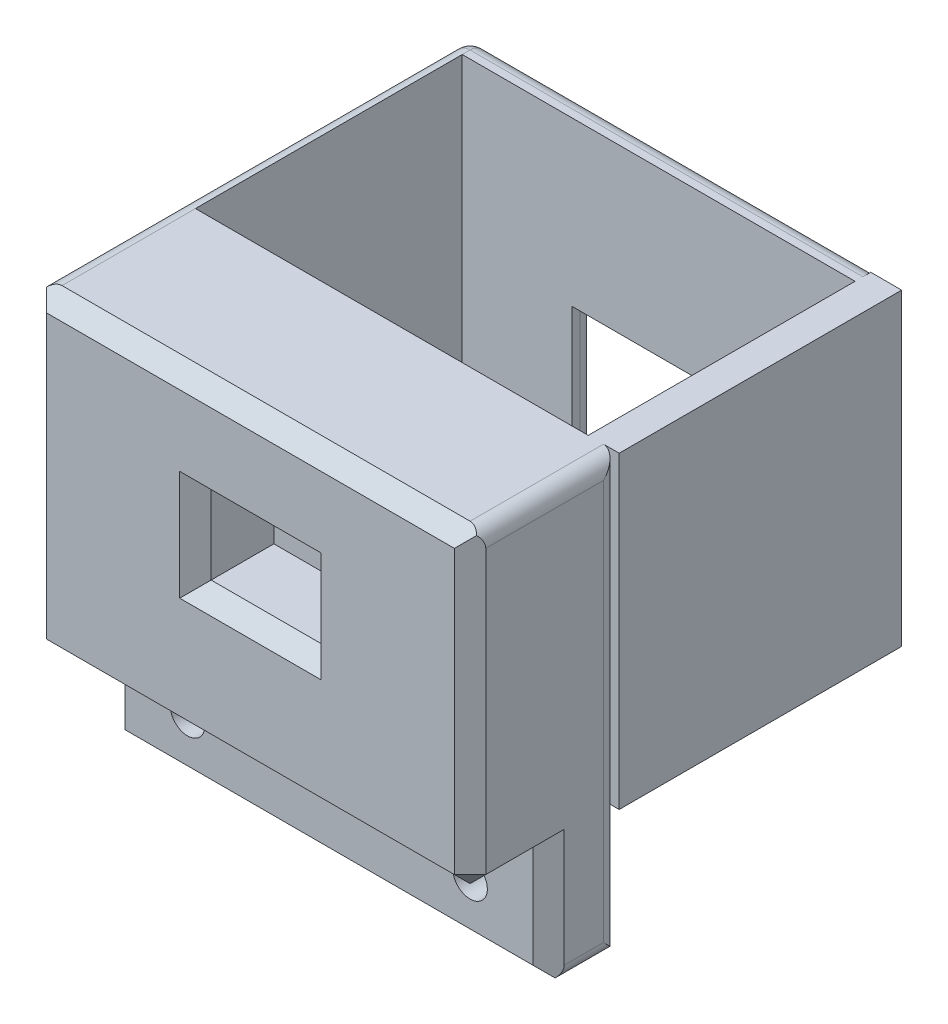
ISO-10303-21;
HEADER;
FILE_DESCRIPTION(('STEP AP214'),'2;1');
FILE_NAME('part.step','',(''),(''),'','','');
FILE_SCHEMA(('AUTOMOTIVE_DESIGN { 1 0 10303 214 1 1 1 1 }'));
ENDSEC;
DATA;
#1=APPLICATION_CONTEXT('core data for automotive mechanical design processes');
#2=APPLICATION_PROTOCOL_DEFINITION('international standard','automotive_design',2000,#1);
#3=PRODUCT_CONTEXT('',#1,'mechanical');
#4=PRODUCT('Part','Part','',(#3));
#5=PRODUCT_RELATED_PRODUCT_CATEGORY('part','',(#4));
#6=PRODUCT_DEFINITION_FORMATION('','',#4);
#7=PRODUCT_DEFINITION_CONTEXT('part definition',#1,'design');
#8=PRODUCT_DEFINITION('design','',#6,#7);
#9=PRODUCT_DEFINITION_SHAPE('','',#8);
#10=(LENGTH_UNIT() NAMED_UNIT(*) SI_UNIT(.MILLI.,.METRE.));
#11=(NAMED_UNIT(*) PLANE_ANGLE_UNIT() SI_UNIT($,.RADIAN.));
#12=(NAMED_UNIT(*) SI_UNIT($,.STERADIAN.) SOLID_ANGLE_UNIT());
#13=UNCERTAINTY_MEASURE_WITH_UNIT(LENGTH_MEASURE(1.E-05),#10,'distance_accuracy_value','');
#14=(GEOMETRIC_REPRESENTATION_CONTEXT(3) GLOBAL_UNCERTAINTY_ASSIGNED_CONTEXT((#13)) GLOBAL_UNIT_ASSIGNED_CONTEXT((#10,
#11,#12)) REPRESENTATION_CONTEXT('',''));
#15=CARTESIAN_POINT('',(0.,0.,0.));
#16=DIRECTION('',(0.,0.,1.));
#17=DIRECTION('',(1.,0.,0.));
#18=AXIS2_PLACEMENT_3D('',#15,#16,#17);
#19=CARTESIAN_POINT('',(-13.,27.5,-4.5));
#20=DIRECTION('',(0.,0.,1.));
#21=DIRECTION('',(0.,-1.,0.));
#22=AXIS2_PLACEMENT_3D('',#19,#20,#21);
#23=PLANE('',#22);
#24=CARTESIAN_POINT('',(-9.,3.75,-4.5));
#25=DIRECTION('',(0.,0.,1.));
#26=DIRECTION('',(0.,-1.,0.));
#27=AXIS2_PLACEMENT_3D('',#24,#25,#26);
#28=CIRCLE('',#27,2.);
#29=CARTESIAN_POINT('',(-9.,1.75,-4.5));
#30=VERTEX_POINT('',#29);
#31=EDGE_CURVE('E413',#30,#30,#28,.F.);
#32=ORIENTED_EDGE('',*,*,#31,.F.);
#33=EDGE_LOOP('',(#32));
#34=FACE_BOUND('',#33,.T.);
#35=CARTESIAN_POINT('',(0.,12.,-4.5));
#36=DIRECTION('',(0.,0.,1.));
#37=DIRECTION('',(0.,-1.,0.));
#38=AXIS2_PLACEMENT_3D('',#35,#36,#37);
#39=CIRCLE('',#38,2.05);
#40=CARTESIAN_POINT('',(0.,9.95,-4.5));
#41=VERTEX_POINT('',#40);
#42=EDGE_CURVE('E406',#41,#41,#39,.F.);
#43=ORIENTED_EDGE('',*,*,#42,.F.);
#44=EDGE_LOOP('',(#43));
#45=FACE_BOUND('',#44,.T.);
#46=CARTESIAN_POINT('',(9.,3.75,-4.5));
#47=DIRECTION('',(0.,0.,1.));
#48=DIRECTION('',(0.,-1.,0.));
#49=AXIS2_PLACEMENT_3D('',#46,#47,#48);
#50=CIRCLE('',#49,2.);
#51=CARTESIAN_POINT('',(9.,1.75,-4.5));
#52=VERTEX_POINT('',#51);
#53=EDGE_CURVE('E410',#52,#52,#50,.F.);
#54=ORIENTED_EDGE('',*,*,#53,.F.);
#55=EDGE_LOOP('',(#54));
#56=FACE_BOUND('',#55,.T.);
#57=DIRECTION('',(-1.,0.,0.));
#58=VECTOR('',#57,1.);
#59=CARTESIAN_POINT('',(14.,7.8390918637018,-4.5));
#60=LINE('',#59,#58);
#61=CARTESIAN_POINT('',(13.,7.8390918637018,-4.5));
#62=VERTEX_POINT('',#61);
#63=CARTESIAN_POINT('',(12.0283108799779,7.8390918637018,-4.5));
#64=VERTEX_POINT('',#63);
#65=EDGE_CURVE('E764',#62,#64,#60,.T.);
#66=ORIENTED_EDGE('',*,*,#65,.F.);
#67=DIRECTION('',(0.,-1.,0.));
#68=VECTOR('',#67,1.);
#69=CARTESIAN_POINT('',(13.,27.5,-4.5));
#70=LINE('',#69,#68);
#71=CARTESIAN_POINT('',(13.,0.,-4.5));
#72=VERTEX_POINT('',#71);
#73=EDGE_CURVE('E671',#62,#72,#70,.T.);
#74=ORIENTED_EDGE('',*,*,#73,.T.);
#75=DIRECTION('',(1.,0.,0.));
#76=VECTOR('',#75,1.);
#77=CARTESIAN_POINT('',(-13.,0.,-4.5));
#78=LINE('',#77,#76);
#79=CARTESIAN_POINT('',(-13.,0.,-4.5));
#80=VERTEX_POINT('',#79);
#81=EDGE_CURVE('E403',#80,#72,#78,.T.);
#82=ORIENTED_EDGE('',*,*,#81,.F.);
#83=DIRECTION('',(0.,-1.,0.));
#84=VECTOR('',#83,1.);
#85=CARTESIAN_POINT('',(-13.,27.5,-4.5));
#86=LINE('',#85,#84);
#87=CARTESIAN_POINT('',(-13.,27.5,-4.5));
#88=VERTEX_POINT('',#87);
#89=EDGE_CURVE('E397',#88,#80,#86,.T.);
#90=ORIENTED_EDGE('',*,*,#89,.F.);
#91=DIRECTION('',(1.,0.,0.));
#92=VECTOR('',#91,1.);
#93=CARTESIAN_POINT('',(-13.,27.5,-4.5));
#94=LINE('',#93,#92);
#95=CARTESIAN_POINT('',(12.0283108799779,27.5,-4.5));
#96=VERTEX_POINT('',#95);
#97=EDGE_CURVE('E59',#88,#96,#94,.T.);
#98=ORIENTED_EDGE('',*,*,#97,.T.);
#99=DIRECTION('',(0.,1.,0.));
#100=VECTOR('',#99,1.);
#101=CARTESIAN_POINT('',(12.0283108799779,27.5,-4.5));
#102=LINE('',#101,#100);
#103=EDGE_CURVE('E54',#64,#96,#102,.T.);
#104=ORIENTED_EDGE('',*,*,#103,.F.);
#105=EDGE_LOOP('',(#66,#74,#82,#90,#98,#104));
#106=FACE_BOUND('',#105,.T.);
#107=ADVANCED_FACE('F39',(#34,#45,#56,#106),#23,.F.);
#108=CARTESIAN_POINT('',(-13.,27.5,-21.5));
#109=DIRECTION('',(0.,0.,-1.));
#110=DIRECTION('',(0.,1.,0.));
#111=AXIS2_PLACEMENT_3D('',#108,#109,#110);
#112=PLANE('',#111);
#113=DIRECTION('',(0.,-1.,0.));
#114=VECTOR('',#113,1.);
#115=CARTESIAN_POINT('',(12.0283108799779,27.5,-21.5));
#116=LINE('',#115,#114);
#117=CARTESIAN_POINT('',(12.0283108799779,27.5,-21.5));
#118=VERTEX_POINT('',#117);
#119=CARTESIAN_POINT('',(12.0283108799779,7.87552601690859,-21.5));
#120=VERTEX_POINT('',#119);
#121=EDGE_CURVE('E369',#118,#120,#116,.T.);
#122=ORIENTED_EDGE('',*,*,#121,.F.);
#123=DIRECTION('',(1.,0.,0.));
#124=VECTOR('',#123,1.);
#125=CARTESIAN_POINT('',(-13.,27.5,-21.5));
#126=LINE('',#125,#124);
#127=CARTESIAN_POINT('',(-13.,27.5,-21.5));
#128=VERTEX_POINT('',#127);
#129=EDGE_CURVE('E402',#128,#118,#126,.T.);
#130=ORIENTED_EDGE('',*,*,#129,.F.);
#131=DIRECTION('',(0.,1.,0.));
#132=VECTOR('',#131,1.);
#133=CARTESIAN_POINT('',(-13.,27.5,-21.5));
#134=LINE('',#133,#132);
#135=CARTESIAN_POINT('',(-13.,7.87552601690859,-21.5));
#136=VERTEX_POINT('',#135);
#137=EDGE_CURVE('E391',#136,#128,#134,.T.);
#138=ORIENTED_EDGE('',*,*,#137,.F.);
#139=DIRECTION('',(1.,0.,0.));
#140=VECTOR('',#139,1.);
#141=CARTESIAN_POINT('',(-13.,7.87552601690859,-21.5));
#142=LINE('',#141,#140);
#143=CARTESIAN_POINT('',(-6.,7.87552601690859,-21.5));
#144=VERTEX_POINT('',#143);
#145=EDGE_CURVE('E378',#136,#144,#142,.T.);
#146=ORIENTED_EDGE('',*,*,#145,.T.);
#147=DIRECTION('',(0.,1.,0.));
#148=VECTOR('',#147,1.);
#149=CARTESIAN_POINT('',(-6.,27.5,-21.5));
#150=LINE('',#149,#148);
#151=CARTESIAN_POINT('',(-6.,17.1014627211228,-21.5));
#152=VERTEX_POINT('',#151);
#153=EDGE_CURVE('E571',#144,#152,#150,.T.);
#154=ORIENTED_EDGE('',*,*,#153,.T.);
#155=DIRECTION('',(1.,0.,0.));
#156=VECTOR('',#155,1.);
#157=CARTESIAN_POINT('',(-13.,17.1014627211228,-21.5));
#158=LINE('',#157,#156);
#159=CARTESIAN_POINT('',(6.,17.1014627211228,-21.5));
#160=VERTEX_POINT('',#159);
#161=EDGE_CURVE('E574',#152,#160,#158,.T.);
#162=ORIENTED_EDGE('',*,*,#161,.T.);
#163=DIRECTION('',(0.,-1.,0.));
#164=VECTOR('',#163,1.);
#165=CARTESIAN_POINT('',(6.,27.5,-21.5));
#166=LINE('',#165,#164);
#167=CARTESIAN_POINT('',(6.,7.87552601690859,-21.5));
#168=VERTEX_POINT('',#167);
#169=EDGE_CURVE('E577',#160,#168,#166,.T.);
#170=ORIENTED_EDGE('',*,*,#169,.T.);
#171=DIRECTION('',(1.,0.,0.));
#172=VECTOR('',#171,1.);
#173=CARTESIAN_POINT('',(-13.,7.87552601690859,-21.5));
#174=LINE('',#173,#172);
#175=EDGE_CURVE('E580',#168,#120,#174,.T.);
#176=ORIENTED_EDGE('',*,*,#175,.T.);
#177=EDGE_LOOP('',(#122,#130,#138,#146,#154,#162,#170,#176));
#178=FACE_BOUND('',#177,.T.);
#179=ADVANCED_FACE('F817',(#178),#112,.F.);
#180=CARTESIAN_POINT('',(14.,7.87552601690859,-20.));
#181=DIRECTION('',(0.,1.,0.));
#182=DIRECTION('',(0.,0.,1.));
#183=AXIS2_PLACEMENT_3D('',#180,#181,#182);
#184=PLANE('',#183);
#185=DIRECTION('',(0.,0.,-1.));
#186=VECTOR('',#185,1.);
#187=CARTESIAN_POINT('',(12.0283108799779,7.87552601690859,-20.));
#188=LINE('',#187,#186);
#189=CARTESIAN_POINT('',(12.0283108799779,7.87552601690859,-22.));
#190=VERTEX_POINT('',#189);
#191=EDGE_CURVE('E366',#120,#190,#188,.T.);
#192=ORIENTED_EDGE('',*,*,#191,.F.);
#193=ORIENTED_EDGE('',*,*,#175,.F.);
#194=DIRECTION('',(0.,0.,-1.));
#195=VECTOR('',#194,1.);
#196=CARTESIAN_POINT('',(6.,7.87552601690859,-20.));
#197=LINE('',#196,#195);
#198=CARTESIAN_POINT('',(6.,7.87552601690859,-22.));
#199=VERTEX_POINT('',#198);
#200=EDGE_CURVE('E375',#168,#199,#197,.T.);
#201=ORIENTED_EDGE('',*,*,#200,.T.);
#202=DIRECTION('',(1.,0.,0.));
#203=VECTOR('',#202,1.);
#204=CARTESIAN_POINT('',(14.,7.87552601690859,-22.));
#205=LINE('',#204,#203);
#206=EDGE_CURVE('E619',#199,#190,#205,.T.);
#207=ORIENTED_EDGE('',*,*,#206,.T.);
#208=EDGE_LOOP('',(#192,#193,#201,#207));
#209=FACE_BOUND('',#208,.T.);
#210=ADVANCED_FACE('F772',(#209),#184,.F.);
#211=CARTESIAN_POINT('',(0.,26.5,-22.));
#212=DIRECTION('',(-1.,0.,0.));
#213=DIRECTION('',(0.,0.,1.));
#214=AXIS2_PLACEMENT_3D('',#211,#212,#213);
#215=CYLINDRICAL_SURFACE('',#214,1.);
#216=DIRECTION('',(1.,0.,0.));
#217=VECTOR('',#216,1.);
#218=CARTESIAN_POINT('',(-14.,27.5,-22.));
#219=LINE('',#218,#217);
#220=CARTESIAN_POINT('',(12.0283108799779,27.5,-22.));
#221=VERTEX_POINT('',#220);
#222=CARTESIAN_POINT('',(-13.,27.5,-22.));
#223=VERTEX_POINT('',#222);
#224=EDGE_CURVE('E607',#221,#223,#219,.F.);
#225=ORIENTED_EDGE('',*,*,#224,.F.);
#226=CARTESIAN_POINT('',(12.0283108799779,26.5,-22.));
#227=DIRECTION('',(1.,0.,0.));
#228=DIRECTION('',(0.,0.,-1.));
#229=AXIS2_PLACEMENT_3D('',#226,#227,#228);
#230=CIRCLE('',#229,1.);
#231=CARTESIAN_POINT('',(12.0283108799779,27.3660254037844,-22.5));
#232=VERTEX_POINT('',#231);
#233=EDGE_CURVE('E372',#221,#232,#230,.F.);
#234=ORIENTED_EDGE('',*,*,#233,.T.);
#235=DIRECTION('',(-1.,0.,0.));
#236=VECTOR('',#235,1.);
#237=CARTESIAN_POINT('',(0.,27.3660254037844,-22.5));
#238=LINE('',#237,#236);
#239=CARTESIAN_POINT('',(13.8660254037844,27.3660254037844,-22.5));
#240=VERTEX_POINT('',#239);
#241=EDGE_CURVE('E358',#240,#232,#238,.T.);
#242=ORIENTED_EDGE('',*,*,#241,.F.);
#243=CARTESIAN_POINT('',(13.,26.5,-22.));
#244=DIRECTION('',(-0.707106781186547,0.707106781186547,0.));
#245=DIRECTION('',(-0.707106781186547,-0.707106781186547,0.));
#246=AXIS2_PLACEMENT_3D('',#243,#244,#245);
#247=ELLIPSE('',#246,1.41421356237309,1.);
#248=CARTESIAN_POINT('',(13.,26.5,-23.));
#249=VERTEX_POINT('',#248);
#250=EDGE_CURVE('E677',#249,#240,#247,.F.);
#251=ORIENTED_EDGE('',*,*,#250,.F.);
#252=DIRECTION('',(1.,0.,0.));
#253=VECTOR('',#252,1.);
#254=CARTESIAN_POINT('',(14.,26.5,-23.));
#255=LINE('',#254,#253);
#256=CARTESIAN_POINT('',(-13.,26.5,-23.));
#257=VERTEX_POINT('',#256);
#258=EDGE_CURVE('E587',#257,#249,#255,.T.);
#259=ORIENTED_EDGE('',*,*,#258,.F.);
#260=CARTESIAN_POINT('',(-13.,26.5,-22.));
#261=DIRECTION('',(-1.,0.,0.));
#262=DIRECTION('',(0.,0.,1.));
#263=AXIS2_PLACEMENT_3D('',#260,#261,#262);
#264=CIRCLE('',#263,1.);
#265=EDGE_CURVE('E683',#257,#223,#264,.F.);
#266=ORIENTED_EDGE('',*,*,#265,.T.);
#267=EDGE_LOOP('',(#225,#234,#242,#251,#259,#266));
#268=FACE_BOUND('',#267,.T.);
#269=ADVANCED_FACE('F748',(#268),#215,.T.);
#270=CARTESIAN_POINT('',(14.,8.87552601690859,-22.));
#271=DIRECTION('',(-1.,0.,0.));
#272=DIRECTION('',(0.,0.,1.));
#273=AXIS2_PLACEMENT_3D('',#270,#271,#272);
#274=CYLINDRICAL_SURFACE('',#273,1.);
#275=DIRECTION('',(-1.,0.,0.));
#276=VECTOR('',#275,1.);
#277=CARTESIAN_POINT('',(14.,8.00950061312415,-22.5));
#278=LINE('',#277,#276);
#279=CARTESIAN_POINT('',(12.0283108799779,8.00950061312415,-22.5));
#280=VERTEX_POINT('',#279);
#281=CARTESIAN_POINT('',(13.8660254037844,8.00950061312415,-22.5));
#282=VERTEX_POINT('',#281);
#283=EDGE_CURVE('E355',#280,#282,#278,.F.);
#284=ORIENTED_EDGE('',*,*,#283,.F.);
#285=CARTESIAN_POINT('',(12.0283108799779,8.87552601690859,-22.));
#286=DIRECTION('',(1.,0.,0.));
#287=DIRECTION('',(0.,0.,-1.));
#288=AXIS2_PLACEMENT_3D('',#285,#286,#287);
#289=CIRCLE('',#288,1.);
#290=EDGE_CURVE('E11',#280,#190,#289,.F.);
#291=ORIENTED_EDGE('',*,*,#290,.T.);
#292=ORIENTED_EDGE('',*,*,#206,.F.);
#293=CARTESIAN_POINT('',(7.,8.87552601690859,-22.));
#294=DIRECTION('',(-0.707106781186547,0.707106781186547,0.));
#295=DIRECTION('',(-0.707106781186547,-0.707106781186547,0.));
#296=AXIS2_PLACEMENT_3D('',#293,#294,#295);
#297=ELLIPSE('',#296,1.41421356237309,1.);
#298=CARTESIAN_POINT('',(7.,8.87552601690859,-23.));
#299=VERTEX_POINT('',#298);
#300=EDGE_CURVE('E680',#199,#299,#297,.F.);
#301=ORIENTED_EDGE('',*,*,#300,.T.);
#302=DIRECTION('',(1.,0.,0.));
#303=VECTOR('',#302,1.);
#304=CARTESIAN_POINT('',(6.,8.87552601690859,-23.));
#305=LINE('',#304,#303);
#306=CARTESIAN_POINT('',(13.,8.87552601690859,-23.));
#307=VERTEX_POINT('',#306);
#308=EDGE_CURVE('E592',#307,#299,#305,.F.);
#309=ORIENTED_EDGE('',*,*,#308,.F.);
#310=CARTESIAN_POINT('',(13.,8.87552601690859,-22.));
#311=DIRECTION('',(-0.707106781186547,-0.707106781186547,0.));
#312=DIRECTION('',(-0.707106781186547,0.707106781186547,0.));
#313=AXIS2_PLACEMENT_3D('',#310,#311,#312);
#314=ELLIPSE('',#313,1.41421356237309,1.);
#315=EDGE_CURVE('E675',#282,#307,#314,.F.);
#316=ORIENTED_EDGE('',*,*,#315,.F.);
#317=EDGE_LOOP('',(#284,#291,#292,#301,#309,#316));
#318=FACE_BOUND('',#317,.T.);
#319=ADVANCED_FACE('F737',(#318),#274,.T.);
#320=CARTESIAN_POINT('',(0.,0.,0.));
#321=DIRECTION('',(0.,-1.,0.));
#322=DIRECTION('',(0.,0.,-1.));
#323=AXIS2_PLACEMENT_3D('',#320,#321,#322);
#324=PLANE('',#323);
#325=DIRECTION('',(-1.,0.,0.));
#326=VECTOR('',#325,1.);
#327=CARTESIAN_POINT('',(-14.,0.,-1.));
#328=LINE('',#327,#326);
#329=CARTESIAN_POINT('',(13.,0.,-1.));
#330=VERTEX_POINT('',#329);
#331=CARTESIAN_POINT('',(-13.,0.,-1.));
#332=VERTEX_POINT('',#331);
#333=EDGE_CURVE('E511',#330,#332,#328,.T.);
#334=ORIENTED_EDGE('',*,*,#333,.T.);
#335=DIRECTION('',(0.,0.,1.));
#336=VECTOR('',#335,1.);
#337=CARTESIAN_POINT('',(-13.,0.,-20.));
#338=LINE('',#337,#336);
#339=EDGE_CURVE('E659',#332,#80,#338,.F.);
#340=ORIENTED_EDGE('',*,*,#339,.T.);
#341=ORIENTED_EDGE('',*,*,#81,.T.);
#342=DIRECTION('',(0.,0.,-1.));
#343=VECTOR('',#342,1.);
#344=CARTESIAN_POINT('',(13.,0.,-1.));
#345=LINE('',#344,#343);
#346=EDGE_CURVE('E657',#72,#330,#345,.F.);
#347=ORIENTED_EDGE('',*,*,#346,.T.);
#348=EDGE_LOOP('',(#334,#340,#341,#347));
#349=FACE_BOUND('',#348,.T.);
#350=ADVANCED_FACE('F871',(#349),#324,.T.);
#351=CARTESIAN_POINT('',(14.,27.5,5.));
#352=DIRECTION('',(-1.,0.,0.));
#353=DIRECTION('',(0.,0.,1.));
#354=AXIS2_PLACEMENT_3D('',#351,#352,#353);
#355=PLANE('',#354);
#356=DIRECTION('',(0.,0.,-1.));
#357=VECTOR('',#356,1.);
#358=CARTESIAN_POINT('',(14.,27.5,5.));
#359=LINE('',#358,#357);
#360=CARTESIAN_POINT('',(14.,27.5,-4.5));
#361=VERTEX_POINT('',#360);
#362=CARTESIAN_POINT('',(14.,27.5,-22.5));
#363=VERTEX_POINT('',#362);
#364=EDGE_CURVE('E462',#361,#363,#359,.T.);
#365=ORIENTED_EDGE('',*,*,#364,.F.);
#366=DIRECTION('',(0.,-1.,0.));
#367=VECTOR('',#366,1.);
#368=CARTESIAN_POINT('',(14.,27.5,-4.5));
#369=LINE('',#368,#367);
#370=CARTESIAN_POINT('',(14.,7.8390918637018,-4.5));
#371=VERTEX_POINT('',#370);
#372=EDGE_CURVE('E354',#361,#371,#369,.T.);
#373=ORIENTED_EDGE('',*,*,#372,.T.);
#374=DIRECTION('',(0.,0.,1.));
#375=VECTOR('',#374,1.);
#376=CARTESIAN_POINT('',(14.,7.8390918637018,-22.5));
#377=LINE('',#376,#375);
#378=CARTESIAN_POINT('',(14.,7.8390918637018,-22.5));
#379=VERTEX_POINT('',#378);
#380=EDGE_CURVE('E333',#379,#371,#377,.T.);
#381=ORIENTED_EDGE('',*,*,#380,.F.);
#382=DIRECTION('',(0.,-1.,0.));
#383=VECTOR('',#382,1.);
#384=CARTESIAN_POINT('',(14.,27.5,-22.5));
#385=LINE('',#384,#383);
#386=EDGE_CURVE('E341',#363,#379,#385,.T.);
#387=ORIENTED_EDGE('',*,*,#386,.F.);
#388=EDGE_LOOP('',(#365,#373,#381,#387));
#389=FACE_BOUND('',#388,.T.);
#390=ADVANCED_FACE('F352',(#389),#355,.F.);
#391=CARTESIAN_POINT('',(-14.,27.5,5.));
#392=DIRECTION('',(0.,0.,-1.));
#393=DIRECTION('',(-1.,0.,0.));
#394=AXIS2_PLACEMENT_3D('',#391,#392,#393);
#395=PLANE('',#394);
#396=DIRECTION('',(-1.,0.,0.));
#397=VECTOR('',#396,1.);
#398=CARTESIAN_POINT('',(-14.,15.,5.));
#399=LINE('',#398,#397);
#400=CARTESIAN_POINT('',(4.5,15.,5.));
#401=VERTEX_POINT('',#400);
#402=CARTESIAN_POINT('',(-4.50000000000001,15.,5.));
#403=VERTEX_POINT('',#402);
#404=EDGE_CURVE('E481',#401,#403,#399,.T.);
#405=ORIENTED_EDGE('',*,*,#404,.T.);
#406=DIRECTION('',(0.,1.,0.));
#407=VECTOR('',#406,1.);
#408=CARTESIAN_POINT('',(-4.50000000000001,27.5,5.));
#409=LINE('',#408,#407);
#410=CARTESIAN_POINT('',(-4.50000000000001,22.,5.));
#411=VERTEX_POINT('',#410);
#412=EDGE_CURVE('E487',#403,#411,#409,.T.);
#413=ORIENTED_EDGE('',*,*,#412,.T.);
#414=DIRECTION('',(1.,0.,0.));
#415=VECTOR('',#414,1.);
#416=CARTESIAN_POINT('',(-14.,22.,5.));
#417=LINE('',#416,#415);
#418=CARTESIAN_POINT('',(4.5,22.,5.));
#419=VERTEX_POINT('',#418);
#420=EDGE_CURVE('E485',#411,#419,#417,.T.);
#421=ORIENTED_EDGE('',*,*,#420,.T.);
#422=DIRECTION('',(0.,-1.,0.));
#423=VECTOR('',#422,1.);
#424=CARTESIAN_POINT('',(4.5,27.5,5.));
#425=LINE('',#424,#423);
#426=EDGE_CURVE('E483',#419,#401,#425,.T.);
#427=ORIENTED_EDGE('',*,*,#426,.T.);
#428=EDGE_LOOP('',(#405,#413,#421,#427));
#429=FACE_BOUND('',#428,.T.);
#430=DIRECTION('',(0.,-1.,0.));
#431=VECTOR('',#430,1.);
#432=CARTESIAN_POINT('',(-13.,27.5,5.));
#433=LINE('',#432,#431);
#434=CARTESIAN_POINT('',(-13.,26.5,5.));
#435=VERTEX_POINT('',#434);
#436=CARTESIAN_POINT('',(-13.,8.5,5.));
#437=VERTEX_POINT('',#436);
#438=EDGE_CURVE('E476',#435,#437,#433,.T.);
#439=ORIENTED_EDGE('',*,*,#438,.T.);
#440=DIRECTION('',(1.,0.,0.));
#441=VECTOR('',#440,1.);
#442=CARTESIAN_POINT('',(14.,8.5,5.));
#443=LINE('',#442,#441);
#444=CARTESIAN_POINT('',(13.,8.5,5.));
#445=VERTEX_POINT('',#444);
#446=EDGE_CURVE('E478',#437,#445,#443,.T.);
#447=ORIENTED_EDGE('',*,*,#446,.T.);
#448=DIRECTION('',(0.,1.,0.));
#449=VECTOR('',#448,1.);
#450=CARTESIAN_POINT('',(13.,27.5,5.));
#451=LINE('',#450,#449);
#452=CARTESIAN_POINT('',(13.,26.5,5.));
#453=VERTEX_POINT('',#452);
#454=EDGE_CURVE('E473',#445,#453,#451,.T.);
#455=ORIENTED_EDGE('',*,*,#454,.T.);
#456=DIRECTION('',(-1.,0.,0.));
#457=VECTOR('',#456,1.);
#458=CARTESIAN_POINT('',(-14.,26.5,5.));
#459=LINE('',#458,#457);
#460=EDGE_CURVE('E471',#453,#435,#459,.T.);
#461=ORIENTED_EDGE('',*,*,#460,.T.);
#462=EDGE_LOOP('',(#439,#447,#455,#461));
#463=FACE_BOUND('',#462,.T.);
#464=ADVANCED_FACE('F898',(#429,#463),#395,.F.);
#465=DIRECTION('',(0.,-1.,0.));
#466=VECTOR('',#465,1.);
#467=CARTESIAN_POINT('',(14.,27.5,-3.5));
#468=LINE('',#467,#466);
#469=CARTESIAN_POINT('',(14.,1.,-3.5));
#470=VERTEX_POINT('',#469);
#471=CARTESIAN_POINT('',(14.,26.5,-3.5));
#472=VERTEX_POINT('',#471);
#473=EDGE_CURVE('E661',#470,#472,#468,.F.);
#474=ORIENTED_EDGE('',*,*,#473,.T.);
#475=DIRECTION('',(0.,0.,-1.));
#476=VECTOR('',#475,1.);
#477=CARTESIAN_POINT('',(14.,26.5,5.));
#478=LINE('',#477,#476);
#479=CARTESIAN_POINT('',(14.,26.5,4.));
#480=VERTEX_POINT('',#479);
#481=EDGE_CURVE('E665',#472,#480,#478,.F.);
#482=ORIENTED_EDGE('',*,*,#481,.T.);
#483=DIRECTION('',(0.,-1.,0.));
#484=VECTOR('',#483,1.);
#485=CARTESIAN_POINT('',(14.,27.5,4.));
#486=LINE('',#485,#484);
#487=CARTESIAN_POINT('',(14.,8.5,4.));
#488=VERTEX_POINT('',#487);
#489=EDGE_CURVE('E514',#480,#488,#486,.T.);
#490=ORIENTED_EDGE('',*,*,#489,.T.);
#491=DIRECTION('',(0.,0.,-1.));
#492=VECTOR('',#491,1.);
#493=CARTESIAN_POINT('',(14.,8.5,0.));
#494=LINE('',#493,#492);
#495=CARTESIAN_POINT('',(14.,8.5,-1.));
#496=VERTEX_POINT('',#495);
#497=EDGE_CURVE('E516',#488,#496,#494,.T.);
#498=ORIENTED_EDGE('',*,*,#497,.T.);
#499=DIRECTION('',(0.,-1.,0.));
#500=VECTOR('',#499,1.);
#501=CARTESIAN_POINT('',(14.,27.5,-1.));
#502=LINE('',#501,#500);
#503=CARTESIAN_POINT('',(14.,1.,-1.));
#504=VERTEX_POINT('',#503);
#505=EDGE_CURVE('E518',#496,#504,#502,.T.);
#506=ORIENTED_EDGE('',*,*,#505,.T.);
#507=DIRECTION('',(0.,0.,-1.));
#508=VECTOR('',#507,1.);
#509=CARTESIAN_POINT('',(14.,1.,-4.5));
#510=LINE('',#509,#508);
#511=EDGE_CURVE('E663',#504,#470,#510,.T.);
#512=ORIENTED_EDGE('',*,*,#511,.T.);
#513=EDGE_LOOP('',(#474,#482,#490,#498,#506,#512));
#514=FACE_BOUND('',#513,.T.);
#515=ADVANCED_FACE('F885',(#514),#355,.F.);
#516=CARTESIAN_POINT('',(-14.,27.5,5.));
#517=DIRECTION('',(1.,0.,0.));
#518=DIRECTION('',(0.,0.,-1.));
#519=AXIS2_PLACEMENT_3D('',#516,#517,#518);
#520=PLANE('',#519);
#521=DIRECTION('',(0.,-1.,0.));
#522=VECTOR('',#521,1.);
#523=CARTESIAN_POINT('',(-14.,27.5,3.5857864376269));
#524=LINE('',#523,#522);
#525=CARTESIAN_POINT('',(-14.,8.9142135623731,3.5857864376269));
#526=VERTEX_POINT('',#525);
#527=CARTESIAN_POINT('',(-14.,26.5,3.5857864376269));
#528=VERTEX_POINT('',#527);
#529=EDGE_CURVE('E638',#526,#528,#524,.F.);
#530=ORIENTED_EDGE('',*,*,#529,.T.);
#531=DIRECTION('',(0.,0.,1.));
#532=VECTOR('',#531,1.);
#533=CARTESIAN_POINT('',(-14.,26.5,5.));
#534=LINE('',#533,#532);
#535=CARTESIAN_POINT('',(-14.,26.5,-22.));
#536=VERTEX_POINT('',#535);
#537=EDGE_CURVE('E640',#528,#536,#534,.F.);
#538=ORIENTED_EDGE('',*,*,#537,.T.);
#539=DIRECTION('',(0.,1.,0.));
#540=VECTOR('',#539,1.);
#541=CARTESIAN_POINT('',(-14.,7.87552601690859,-22.));
#542=LINE('',#541,#540);
#543=CARTESIAN_POINT('',(-14.,8.87552601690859,-22.));
#544=VERTEX_POINT('',#543);
#545=EDGE_CURVE('E626',#536,#544,#542,.F.);
#546=ORIENTED_EDGE('',*,*,#545,.T.);
#547=DIRECTION('',(0.,0.,-1.));
#548=VECTOR('',#547,1.);
#549=CARTESIAN_POINT('',(-14.,8.87552601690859,5.));
#550=LINE('',#549,#548);
#551=CARTESIAN_POINT('',(-14.,8.87552601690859,-19.));
#552=VERTEX_POINT('',#551);
#553=EDGE_CURVE('E628',#544,#552,#550,.F.);
#554=ORIENTED_EDGE('',*,*,#553,.T.);
#555=DIRECTION('',(0.,1.,0.));
#556=VECTOR('',#555,1.);
#557=CARTESIAN_POINT('',(-14.,0.,-19.));
#558=LINE('',#557,#556);
#559=CARTESIAN_POINT('',(-14.,1.,-19.));
#560=VERTEX_POINT('',#559);
#561=EDGE_CURVE('E630',#552,#560,#558,.F.);
#562=ORIENTED_EDGE('',*,*,#561,.T.);
#563=DIRECTION('',(0.,0.,1.));
#564=VECTOR('',#563,1.);
#565=CARTESIAN_POINT('',(-14.,1.,-1.));
#566=LINE('',#565,#564);
#567=CARTESIAN_POINT('',(-14.,1.,-1.4142135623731));
#568=VERTEX_POINT('',#567);
#569=EDGE_CURVE('E632',#560,#568,#566,.T.);
#570=ORIENTED_EDGE('',*,*,#569,.T.);
#571=DIRECTION('',(0.,-1.,0.));
#572=VECTOR('',#571,1.);
#573=CARTESIAN_POINT('',(-14.,8.5,-1.4142135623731));
#574=LINE('',#573,#572);
#575=CARTESIAN_POINT('',(-14.,8.9142135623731,-1.4142135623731));
#576=VERTEX_POINT('',#575);
#577=EDGE_CURVE('E634',#568,#576,#574,.F.);
#578=ORIENTED_EDGE('',*,*,#577,.T.);
#579=DIRECTION('',(0.,0.,1.));
#580=VECTOR('',#579,1.);
#581=CARTESIAN_POINT('',(-14.,8.9142135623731,4.));
#582=LINE('',#581,#580);
#583=EDGE_CURVE('E636',#576,#526,#582,.T.);
#584=ORIENTED_EDGE('',*,*,#583,.T.);
#585=EDGE_LOOP('',(#530,#538,#546,#554,#562,#570,#578,#584));
#586=FACE_BOUND('',#585,.T.);
#587=ADVANCED_FACE('F1006',(#586),#520,.F.);
#588=CARTESIAN_POINT('',(0.,27.5,0.));
#589=DIRECTION('',(0.,-1.,0.));
#590=DIRECTION('',(0.,0.,-1.));
#591=AXIS2_PLACEMENT_3D('',#588,#589,#590);
#592=PLANE('',#591);
#593=ORIENTED_EDGE('',*,*,#97,.F.);
#594=DIRECTION('',(0.,0.,1.));
#595=VECTOR('',#594,1.);
#596=CARTESIAN_POINT('',(-13.,27.5,0.));
#597=LINE('',#596,#595);
#598=CARTESIAN_POINT('',(-13.,27.5,4.));
#599=VERTEX_POINT('',#598);
#600=EDGE_CURVE('E603',#88,#599,#597,.T.);
#601=ORIENTED_EDGE('',*,*,#600,.T.);
#602=DIRECTION('',(1.,0.,0.));
#603=VECTOR('',#602,1.);
#604=CARTESIAN_POINT('',(0.,27.5,4.));
#605=LINE('',#604,#603);
#606=CARTESIAN_POINT('',(13.,27.5,4.));
#607=VERTEX_POINT('',#606);
#608=EDGE_CURVE('E521',#599,#607,#605,.T.);
#609=ORIENTED_EDGE('',*,*,#608,.T.);
#610=DIRECTION('',(0.,0.,-1.));
#611=VECTOR('',#610,1.);
#612=CARTESIAN_POINT('',(13.,27.5,0.));
#613=LINE('',#612,#611);
#614=CARTESIAN_POINT('',(13.,27.5,-4.5));
#615=VERTEX_POINT('',#614);
#616=EDGE_CURVE('E600',#607,#615,#613,.T.);
#617=ORIENTED_EDGE('',*,*,#616,.T.);
#618=DIRECTION('',(1.,0.,0.));
#619=VECTOR('',#618,1.);
#620=CARTESIAN_POINT('',(14.,27.5,-4.5));
#621=LINE('',#620,#619);
#622=EDGE_CURVE('E350',#615,#361,#621,.T.);
#623=ORIENTED_EDGE('',*,*,#622,.T.);
#624=ORIENTED_EDGE('',*,*,#364,.T.);
#625=DIRECTION('',(1.,0.,0.));
#626=VECTOR('',#625,1.);
#627=CARTESIAN_POINT('',(14.,27.5,-22.5));
#628=LINE('',#627,#626);
#629=CARTESIAN_POINT('',(12.0283108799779,27.5,-22.5));
#630=VERTEX_POINT('',#629);
#631=EDGE_CURVE('E348',#630,#363,#628,.T.);
#632=ORIENTED_EDGE('',*,*,#631,.F.);
#633=DIRECTION('',(0.,0.,1.));
#634=VECTOR('',#633,1.);
#635=CARTESIAN_POINT('',(12.0283108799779,27.5,-22.5));
#636=LINE('',#635,#634);
#637=EDGE_CURVE('E360',#630,#221,#636,.T.);
#638=ORIENTED_EDGE('',*,*,#637,.T.);
#639=ORIENTED_EDGE('',*,*,#224,.T.);
#640=DIRECTION('',(0.,0.,1.));
#641=VECTOR('',#640,1.);
#642=CARTESIAN_POINT('',(-13.,27.5,0.));
#643=LINE('',#642,#641);
#644=EDGE_CURVE('E605',#223,#128,#643,.T.);
#645=ORIENTED_EDGE('',*,*,#644,.T.);
#646=ORIENTED_EDGE('',*,*,#129,.T.);
#647=EDGE_CURVE('E757',#118,#96,#636,.T.);
#648=ORIENTED_EDGE('',*,*,#647,.T.);
#649=EDGE_LOOP('',(#593,#601,#609,#617,#623,#624,#632,#638,#639,#645,#646,#648));
#650=FACE_BOUND('',#649,.T.);
#651=ADVANCED_FACE('F755',(#650),#592,.F.);
#652=CARTESIAN_POINT('',(-14.,7.5,0.));
#653=DIRECTION('',(0.,0.,-1.));
#654=DIRECTION('',(-1.,0.,0.));
#655=AXIS2_PLACEMENT_3D('',#652,#653,#654);
#656=PLANE('',#655);
#657=CARTESIAN_POINT('',(9.,3.75,0.));
#658=DIRECTION('',(0.,0.,-1.));
#659=DIRECTION('',(-1.,0.,0.));
#660=AXIS2_PLACEMENT_3D('',#657,#658,#659);
#661=CIRCLE('',#660,1.1);
#662=CARTESIAN_POINT('',(7.9,3.75,0.));
#663=VERTEX_POINT('',#662);
#664=EDGE_CURVE('E459',#663,#663,#661,.T.);
#665=ORIENTED_EDGE('',*,*,#664,.T.);
#666=EDGE_LOOP('',(#665));
#667=FACE_BOUND('',#666,.T.);
#668=CARTESIAN_POINT('',(-9.,3.75,0.));
#669=DIRECTION('',(0.,0.,-1.));
#670=DIRECTION('',(-1.,0.,0.));
#671=AXIS2_PLACEMENT_3D('',#668,#669,#670);
#672=CIRCLE('',#671,1.1);
#673=CARTESIAN_POINT('',(-10.1,3.75,0.));
#674=VERTEX_POINT('',#673);
#675=EDGE_CURVE('E449',#674,#674,#672,.T.);
#676=ORIENTED_EDGE('',*,*,#675,.T.);
#677=EDGE_LOOP('',(#676));
#678=FACE_BOUND('',#677,.T.);
#679=DIRECTION('',(1.,0.,0.));
#680=VECTOR('',#679,1.);
#681=CARTESIAN_POINT('',(-14.,7.5,0.));
#682=LINE('',#681,#680);
#683=CARTESIAN_POINT('',(-13.,7.5,0.));
#684=VERTEX_POINT('',#683);
#685=CARTESIAN_POINT('',(13.,7.5,0.));
#686=VERTEX_POINT('',#685);
#687=EDGE_CURVE('E455',#684,#686,#682,.T.);
#688=ORIENTED_EDGE('',*,*,#687,.F.);
#689=DIRECTION('',(0.,-1.,0.));
#690=VECTOR('',#689,1.);
#691=CARTESIAN_POINT('',(-13.,7.5,0.));
#692=LINE('',#691,#690);
#693=CARTESIAN_POINT('',(-13.,1.,0.));
#694=VERTEX_POINT('',#693);
#695=EDGE_CURVE('E508',#684,#694,#692,.T.);
#696=ORIENTED_EDGE('',*,*,#695,.T.);
#697=DIRECTION('',(1.,0.,0.));
#698=VECTOR('',#697,1.);
#699=CARTESIAN_POINT('',(14.,1.,0.));
#700=LINE('',#699,#698);
#701=CARTESIAN_POINT('',(13.,1.,0.));
#702=VERTEX_POINT('',#701);
#703=EDGE_CURVE('E506',#694,#702,#700,.T.);
#704=ORIENTED_EDGE('',*,*,#703,.T.);
#705=DIRECTION('',(0.,1.,0.));
#706=VECTOR('',#705,1.);
#707=CARTESIAN_POINT('',(13.,7.5,0.));
#708=LINE('',#707,#706);
#709=EDGE_CURVE('E504',#702,#686,#708,.T.);
#710=ORIENTED_EDGE('',*,*,#709,.T.);
#711=EDGE_LOOP('',(#688,#696,#704,#710));
#712=FACE_BOUND('',#711,.T.);
#713=ADVANCED_FACE('F917',(#667,#678,#712),#656,.F.);
#714=CARTESIAN_POINT('',(0.,7.5,0.));
#715=DIRECTION('',(0.,-1.,0.));
#716=DIRECTION('',(0.,0.,-1.));
#717=AXIS2_PLACEMENT_3D('',#714,#715,#716);
#718=PLANE('',#717);
#719=DIRECTION('',(-1.,0.,0.));
#720=VECTOR('',#719,1.);
#721=CARTESIAN_POINT('',(-14.,7.5,4.));
#722=LINE('',#721,#720);
#723=CARTESIAN_POINT('',(13.,7.5,4.));
#724=VERTEX_POINT('',#723);
#725=CARTESIAN_POINT('',(-13.,7.5,4.));
#726=VERTEX_POINT('',#725);
#727=EDGE_CURVE('E498',#724,#726,#722,.T.);
#728=ORIENTED_EDGE('',*,*,#727,.T.);
#729=DIRECTION('',(0.,0.,-1.));
#730=VECTOR('',#729,1.);
#731=CARTESIAN_POINT('',(-13.,7.5,0.));
#732=LINE('',#731,#730);
#733=EDGE_CURVE('E501',#726,#684,#732,.T.);
#734=ORIENTED_EDGE('',*,*,#733,.T.);
#735=ORIENTED_EDGE('',*,*,#687,.T.);
#736=DIRECTION('',(0.,0.,1.));
#737=VECTOR('',#736,1.);
#738=CARTESIAN_POINT('',(13.,7.5,5.));
#739=LINE('',#738,#737);
#740=EDGE_CURVE('E496',#686,#724,#739,.T.);
#741=ORIENTED_EDGE('',*,*,#740,.T.);
#742=EDGE_LOOP('',(#728,#734,#735,#741));
#743=FACE_BOUND('',#742,.T.);
#744=ADVANCED_FACE('F919',(#743),#718,.T.);
#745=CARTESIAN_POINT('',(-9.,3.75,-3.));
#746=DIRECTION('',(0.,0.,-1.));
#747=DIRECTION('',(-1.,0.,0.));
#748=AXIS2_PLACEMENT_3D('',#745,#746,#747);
#749=CYLINDRICAL_SURFACE('',#748,2.);
#750=ORIENTED_EDGE('',*,*,#31,.T.);
#751=EDGE_LOOP('',(#750));
#752=FACE_BOUND('',#751,.T.);
#753=CARTESIAN_POINT('',(-9.,3.75,-3.));
#754=DIRECTION('',(0.,0.,-1.));
#755=DIRECTION('',(-1.,0.,0.));
#756=AXIS2_PLACEMENT_3D('',#753,#754,#755);
#757=CIRCLE('',#756,2.);
#758=CARTESIAN_POINT('',(-11.,3.75,-3.));
#759=VERTEX_POINT('',#758);
#760=EDGE_CURVE('E456',#759,#759,#757,.T.);
#761=ORIENTED_EDGE('',*,*,#760,.F.);
#762=EDGE_LOOP('',(#761));
#763=FACE_BOUND('',#762,.T.);
#764=ADVANCED_FACE('F992',(#752,#763),#749,.F.);
#765=CARTESIAN_POINT('',(-9.,3.75,-3.));
#766=DIRECTION('',(0.,0.,-1.));
#767=DIRECTION('',(-1.,0.,0.));
#768=AXIS2_PLACEMENT_3D('',#765,#766,#767);
#769=PLANE('',#768);
#770=CARTESIAN_POINT('',(-9.,3.75,-3.));
#771=DIRECTION('',(0.,0.,-1.));
#772=DIRECTION('',(-1.,0.,0.));
#773=AXIS2_PLACEMENT_3D('',#770,#771,#772);
#774=CIRCLE('',#773,1.1);
#775=CARTESIAN_POINT('',(-10.1,3.75,-3.));
#776=VERTEX_POINT('',#775);
#777=EDGE_CURVE('E437',#776,#776,#774,.T.);
#778=ORIENTED_EDGE('',*,*,#777,.F.);
#779=EDGE_LOOP('',(#778));
#780=FACE_BOUND('',#779,.T.);
#781=ORIENTED_EDGE('',*,*,#760,.T.);
#782=EDGE_LOOP('',(#781));
#783=FACE_BOUND('',#782,.T.);
#784=ADVANCED_FACE('F990',(#780,#783),#769,.T.);
#785=CARTESIAN_POINT('',(9.,3.75,-3.));
#786=DIRECTION('',(0.,0.,-1.));
#787=DIRECTION('',(-1.,0.,0.));
#788=AXIS2_PLACEMENT_3D('',#785,#786,#787);
#789=CYLINDRICAL_SURFACE('',#788,2.);
#790=ORIENTED_EDGE('',*,*,#53,.T.);
#791=EDGE_LOOP('',(#790));
#792=FACE_BOUND('',#791,.T.);
#793=CARTESIAN_POINT('',(9.,3.75,-3.));
#794=DIRECTION('',(0.,0.,-1.));
#795=DIRECTION('',(-1.,0.,0.));
#796=AXIS2_PLACEMENT_3D('',#793,#794,#795);
#797=CIRCLE('',#796,2.);
#798=CARTESIAN_POINT('',(7.,3.75,-3.));
#799=VERTEX_POINT('',#798);
#800=EDGE_CURVE('E452',#799,#799,#797,.T.);
#801=ORIENTED_EDGE('',*,*,#800,.F.);
#802=EDGE_LOOP('',(#801));
#803=FACE_BOUND('',#802,.T.);
#804=ADVANCED_FACE('F986',(#792,#803),#789,.F.);
#805=CARTESIAN_POINT('',(9.,3.75,-3.));
#806=DIRECTION('',(0.,0.,-1.));
#807=DIRECTION('',(-1.,0.,0.));
#808=AXIS2_PLACEMENT_3D('',#805,#806,#807);
#809=PLANE('',#808);
#810=CARTESIAN_POINT('',(9.,3.75,-3.));
#811=DIRECTION('',(0.,0.,-1.));
#812=DIRECTION('',(-1.,0.,0.));
#813=AXIS2_PLACEMENT_3D('',#810,#811,#812);
#814=CIRCLE('',#813,1.1);
#815=CARTESIAN_POINT('',(7.9,3.75,-3.));
#816=VERTEX_POINT('',#815);
#817=EDGE_CURVE('E446',#816,#816,#814,.T.);
#818=ORIENTED_EDGE('',*,*,#817,.F.);
#819=EDGE_LOOP('',(#818));
#820=FACE_BOUND('',#819,.T.);
#821=ORIENTED_EDGE('',*,*,#800,.T.);
#822=EDGE_LOOP('',(#821));
#823=FACE_BOUND('',#822,.T.);
#824=ADVANCED_FACE('F982',(#820,#823),#809,.T.);
#825=CARTESIAN_POINT('',(-9.,3.75,2.));
#826=DIRECTION('',(0.,0.,-1.));
#827=DIRECTION('',(-1.,0.,0.));
#828=AXIS2_PLACEMENT_3D('',#825,#826,#827);
#829=CYLINDRICAL_SURFACE('',#828,1.1);
#830=ORIENTED_EDGE('',*,*,#777,.T.);
#831=EDGE_LOOP('',(#830));
#832=FACE_BOUND('',#831,.T.);
#833=ORIENTED_EDGE('',*,*,#675,.F.);
#834=EDGE_LOOP('',(#833));
#835=FACE_BOUND('',#834,.T.);
#836=ADVANCED_FACE('F978',(#832,#835),#829,.F.);
#837=CARTESIAN_POINT('',(9.,3.75,2.));
#838=DIRECTION('',(0.,0.,-1.));
#839=DIRECTION('',(-1.,0.,0.));
#840=AXIS2_PLACEMENT_3D('',#837,#838,#839);
#841=CYLINDRICAL_SURFACE('',#840,1.1);
#842=ORIENTED_EDGE('',*,*,#817,.T.);
#843=EDGE_LOOP('',(#842));
#844=FACE_BOUND('',#843,.T.);
#845=ORIENTED_EDGE('',*,*,#664,.F.);
#846=EDGE_LOOP('',(#845));
#847=FACE_BOUND('',#846,.T.);
#848=ADVANCED_FACE('F974',(#844,#847),#841,.F.);
#849=CARTESIAN_POINT('',(3.5,16.,0.));
#850=DIRECTION('',(1.,0.,0.));
#851=DIRECTION('',(0.,0.,-1.));
#852=AXIS2_PLACEMENT_3D('',#849,#850,#851);
#853=PLANE('',#852);
#854=DIRECTION('',(0.,0.,1.));
#855=VECTOR('',#854,1.);
#856=CARTESIAN_POINT('',(3.5,16.,0.));
#857=LINE('',#856,#855);
#858=CARTESIAN_POINT('',(3.5,16.,0.));
#859=VERTEX_POINT('',#858);
#860=CARTESIAN_POINT('',(3.5,16.,4.));
#861=VERTEX_POINT('',#860);
#862=EDGE_CURVE('E434',#859,#861,#857,.T.);
#863=ORIENTED_EDGE('',*,*,#862,.T.);
#864=DIRECTION('',(0.,1.,0.));
#865=VECTOR('',#864,1.);
#866=CARTESIAN_POINT('',(3.5,16.,4.));
#867=LINE('',#866,#865);
#868=CARTESIAN_POINT('',(3.5,21.,4.));
#869=VERTEX_POINT('',#868);
#870=EDGE_CURVE('E492',#861,#869,#867,.T.);
#871=ORIENTED_EDGE('',*,*,#870,.T.);
#872=DIRECTION('',(0.,0.,1.));
#873=VECTOR('',#872,1.);
#874=CARTESIAN_POINT('',(3.5,21.,0.));
#875=LINE('',#874,#873);
#876=CARTESIAN_POINT('',(3.5,21.,0.));
#877=VERTEX_POINT('',#876);
#878=EDGE_CURVE('E433',#877,#869,#875,.T.);
#879=ORIENTED_EDGE('',*,*,#878,.F.);
#880=DIRECTION('',(0.,1.,0.));
#881=VECTOR('',#880,1.);
#882=CARTESIAN_POINT('',(3.5,16.,0.));
#883=LINE('',#882,#881);
#884=EDGE_CURVE('E420',#859,#877,#883,.T.);
#885=ORIENTED_EDGE('',*,*,#884,.F.);
#886=EDGE_LOOP('',(#863,#871,#879,#885));
#887=FACE_BOUND('',#886,.T.);
#888=ADVANCED_FACE('F964',(#887),#853,.F.);
#889=CARTESIAN_POINT('',(-3.5,16.,0.));
#890=DIRECTION('',(0.,-1.,0.));
#891=DIRECTION('',(0.,0.,-1.));
#892=AXIS2_PLACEMENT_3D('',#889,#890,#891);
#893=PLANE('',#892);
#894=DIRECTION('',(0.,0.,1.));
#895=VECTOR('',#894,1.);
#896=CARTESIAN_POINT('',(-3.5,16.,0.));
#897=LINE('',#896,#895);
#898=CARTESIAN_POINT('',(-3.5,16.,0.));
#899=VERTEX_POINT('',#898);
#900=CARTESIAN_POINT('',(-3.5,16.,4.));
#901=VERTEX_POINT('',#900);
#902=EDGE_CURVE('E438',#899,#901,#897,.T.);
#903=ORIENTED_EDGE('',*,*,#902,.T.);
#904=DIRECTION('',(1.,0.,0.));
#905=VECTOR('',#904,1.);
#906=CARTESIAN_POINT('',(-3.5,16.,4.));
#907=LINE('',#906,#905);
#908=EDGE_CURVE('E494',#901,#861,#907,.T.);
#909=ORIENTED_EDGE('',*,*,#908,.T.);
#910=ORIENTED_EDGE('',*,*,#862,.F.);
#911=DIRECTION('',(1.,0.,0.));
#912=VECTOR('',#911,1.);
#913=CARTESIAN_POINT('',(-3.5,16.,0.));
#914=LINE('',#913,#912);
#915=EDGE_CURVE('E430',#899,#859,#914,.T.);
#916=ORIENTED_EDGE('',*,*,#915,.F.);
#917=EDGE_LOOP('',(#903,#909,#910,#916));
#918=FACE_BOUND('',#917,.T.);
#919=ADVANCED_FACE('F960',(#918),#893,.F.);
#920=CARTESIAN_POINT('',(-3.5,16.,0.));
#921=DIRECTION('',(-1.,0.,0.));
#922=DIRECTION('',(0.,0.,1.));
#923=AXIS2_PLACEMENT_3D('',#920,#921,#922);
#924=PLANE('',#923);
#925=DIRECTION('',(0.,0.,1.));
#926=VECTOR('',#925,1.);
#927=CARTESIAN_POINT('',(-3.5,21.,0.));
#928=LINE('',#927,#926);
#929=CARTESIAN_POINT('',(-3.5,21.,0.));
#930=VERTEX_POINT('',#929);
#931=CARTESIAN_POINT('',(-3.5,21.,4.));
#932=VERTEX_POINT('',#931);
#933=EDGE_CURVE('E441',#930,#932,#928,.T.);
#934=ORIENTED_EDGE('',*,*,#933,.T.);
#935=DIRECTION('',(0.,-1.,0.));
#936=VECTOR('',#935,1.);
#937=CARTESIAN_POINT('',(-3.5,16.,4.));
#938=LINE('',#937,#936);
#939=EDGE_CURVE('E464',#932,#901,#938,.T.);
#940=ORIENTED_EDGE('',*,*,#939,.T.);
#941=ORIENTED_EDGE('',*,*,#902,.F.);
#942=DIRECTION('',(0.,-1.,0.));
#943=VECTOR('',#942,1.);
#944=CARTESIAN_POINT('',(-3.5,16.,0.));
#945=LINE('',#944,#943);
#946=EDGE_CURVE('E427',#930,#899,#945,.T.);
#947=ORIENTED_EDGE('',*,*,#946,.F.);
#948=EDGE_LOOP('',(#934,#940,#941,#947));
#949=FACE_BOUND('',#948,.T.);
#950=ADVANCED_FACE('F963',(#949),#924,.F.);
#951=CARTESIAN_POINT('',(-3.5,21.,0.));
#952=DIRECTION('',(0.,1.,0.));
#953=DIRECTION('',(0.,0.,1.));
#954=AXIS2_PLACEMENT_3D('',#951,#952,#953);
#955=PLANE('',#954);
#956=ORIENTED_EDGE('',*,*,#878,.T.);
#957=DIRECTION('',(-1.,0.,0.));
#958=VECTOR('',#957,1.);
#959=CARTESIAN_POINT('',(-3.5,21.,4.));
#960=LINE('',#959,#958);
#961=EDGE_CURVE('E490',#869,#932,#960,.T.);
#962=ORIENTED_EDGE('',*,*,#961,.T.);
#963=ORIENTED_EDGE('',*,*,#933,.F.);
#964=DIRECTION('',(-1.,0.,0.));
#965=VECTOR('',#964,1.);
#966=CARTESIAN_POINT('',(-3.5,21.,0.));
#967=LINE('',#966,#965);
#968=EDGE_CURVE('E423',#877,#930,#967,.T.);
#969=ORIENTED_EDGE('',*,*,#968,.F.);
#970=EDGE_LOOP('',(#956,#962,#963,#969));
#971=FACE_BOUND('',#970,.T.);
#972=ADVANCED_FACE('F958',(#971),#955,.F.);
#973=CARTESIAN_POINT('',(0.,0.,0.));
#974=DIRECTION('',(0.,0.,-1.));
#975=DIRECTION('',(-1.,0.,0.));
#976=AXIS2_PLACEMENT_3D('',#973,#974,#975);
#977=PLANE('',#976);
#978=ORIENTED_EDGE('',*,*,#884,.T.);
#979=ORIENTED_EDGE('',*,*,#968,.T.);
#980=ORIENTED_EDGE('',*,*,#946,.T.);
#981=ORIENTED_EDGE('',*,*,#915,.T.);
#982=EDGE_LOOP('',(#978,#979,#980,#981));
#983=FACE_BOUND('',#982,.T.);
#984=ADVANCED_FACE('F954',(#983),#977,.F.);
#985=CARTESIAN_POINT('',(3.5,16.,4.));
#986=DIRECTION('',(0.707106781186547,0.,-0.707106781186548));
#987=DIRECTION('',(0.,1.,0.));
#988=AXIS2_PLACEMENT_3D('',#985,#986,#987);
#989=PLANE('',#988);
#990=DIRECTION('',(-0.577350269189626,0.577350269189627,-0.577350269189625));
#991=VECTOR('',#990,1.);
#992=CARTESIAN_POINT('',(3.5,16.,4.));
#993=LINE('',#992,#991);
#994=EDGE_CURVE('E530',#401,#861,#993,.T.);
#995=ORIENTED_EDGE('',*,*,#994,.F.);
#996=ORIENTED_EDGE('',*,*,#426,.F.);
#997=DIRECTION('',(-0.577350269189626,-0.577350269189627,-0.577350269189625));
#998=VECTOR('',#997,1.);
#999=CARTESIAN_POINT('',(1.16666666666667,18.6666666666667,1.66666666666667));
#1000=LINE('',#999,#998);
#1001=EDGE_CURVE('E424',#869,#419,#1000,.F.);
#1002=ORIENTED_EDGE('',*,*,#1001,.F.);
#1003=ORIENTED_EDGE('',*,*,#870,.F.);
#1004=EDGE_LOOP('',(#995,#996,#1002,#1003));
#1005=FACE_BOUND('',#1004,.T.);
#1006=ADVANCED_FACE('F957',(#1005),#989,.F.);
#1007=CARTESIAN_POINT('',(-3.5,21.,4.));
#1008=DIRECTION('',(0.,0.707106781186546,-0.707106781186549));
#1009=DIRECTION('',(-1.,0.,0.));
#1010=AXIS2_PLACEMENT_3D('',#1007,#1008,#1009);
#1011=PLANE('',#1010);
#1012=ORIENTED_EDGE('',*,*,#1001,.T.);
#1013=ORIENTED_EDGE('',*,*,#420,.F.);
#1014=DIRECTION('',(0.577350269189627,-0.577350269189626,-0.577350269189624));
#1015=VECTOR('',#1014,1.);
#1016=CARTESIAN_POINT('',(-1.83333333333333,19.3333333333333,2.33333333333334));
#1017=LINE('',#1016,#1015);
#1018=EDGE_CURVE('E527',#932,#411,#1017,.F.);
#1019=ORIENTED_EDGE('',*,*,#1018,.F.);
#1020=ORIENTED_EDGE('',*,*,#961,.F.);
#1021=EDGE_LOOP('',(#1012,#1013,#1019,#1020));
#1022=FACE_BOUND('',#1021,.T.);
#1023=ADVANCED_FACE('F1032',(#1022),#1011,.F.);
#1024=CARTESIAN_POINT('',(-3.5,16.,4.));
#1025=DIRECTION('',(0.,-0.707106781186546,-0.707106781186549));
#1026=DIRECTION('',(1.,0.,0.));
#1027=AXIS2_PLACEMENT_3D('',#1024,#1025,#1026);
#1028=PLANE('',#1027);
#1029=ORIENTED_EDGE('',*,*,#994,.T.);
#1030=ORIENTED_EDGE('',*,*,#908,.F.);
#1031=DIRECTION('',(-0.577350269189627,-0.577350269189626,0.577350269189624));
#1032=VECTOR('',#1031,1.);
#1033=CARTESIAN_POINT('',(-3.5,16.,4.));
#1034=LINE('',#1033,#1032);
#1035=EDGE_CURVE('E525',#403,#901,#1034,.F.);
#1036=ORIENTED_EDGE('',*,*,#1035,.F.);
#1037=ORIENTED_EDGE('',*,*,#404,.F.);
#1038=EDGE_LOOP('',(#1029,#1030,#1036,#1037));
#1039=FACE_BOUND('',#1038,.T.);
#1040=ADVANCED_FACE('F1025',(#1039),#1028,.F.);
#1041=CARTESIAN_POINT('',(-3.5,16.,4.));
#1042=DIRECTION('',(-0.707106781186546,0.,-0.707106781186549));
#1043=DIRECTION('',(0.,-1.,0.));
#1044=AXIS2_PLACEMENT_3D('',#1041,#1042,#1043);
#1045=PLANE('',#1044);
#1046=ORIENTED_EDGE('',*,*,#1018,.T.);
#1047=ORIENTED_EDGE('',*,*,#412,.F.);
#1048=ORIENTED_EDGE('',*,*,#1035,.T.);
#1049=ORIENTED_EDGE('',*,*,#939,.F.);
#1050=EDGE_LOOP('',(#1046,#1047,#1048,#1049));
#1051=FACE_BOUND('',#1050,.T.);
#1052=ADVANCED_FACE('F1018',(#1051),#1045,.F.);
#1053=CARTESIAN_POINT('',(-14.,1.,0.));
#1054=DIRECTION('',(0.,-0.707106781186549,0.707106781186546));
#1055=DIRECTION('',(-1.,0.,0.));
#1056=AXIS2_PLACEMENT_3D('',#1053,#1054,#1055);
#1057=PLANE('',#1056);
#1058=DIRECTION('',(-0.577350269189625,-0.577350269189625,-0.577350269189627));
#1059=VECTOR('',#1058,1.);
#1060=CARTESIAN_POINT('',(-10.8333333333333,3.16666666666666,2.16666666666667));
#1061=LINE('',#1060,#1059);
#1062=CARTESIAN_POINT('',(-13.7071067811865,0.292893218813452,-0.707106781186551));
#1063=VERTEX_POINT('',#1062);
#1064=EDGE_CURVE('E560',#1063,#694,#1061,.F.);
#1065=ORIENTED_EDGE('',*,*,#1064,.F.);
#1066=CARTESIAN_POINT('',(-13.,1.,0.));
#1067=DIRECTION('',(0.,-0.707106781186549,0.707106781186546));
#1068=DIRECTION('',(0.,-0.707106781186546,-0.707106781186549));
#1069=AXIS2_PLACEMENT_3D('',#1066,#1067,#1068);
#1070=ELLIPSE('',#1069,1.4142135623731,1.);
#1071=EDGE_CURVE('E655',#1063,#332,#1070,.T.);
#1072=ORIENTED_EDGE('',*,*,#1071,.T.);
#1073=ORIENTED_EDGE('',*,*,#333,.F.);
#1074=CARTESIAN_POINT('',(13.,1.,0.));
#1075=DIRECTION('',(0.,-0.707106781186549,0.707106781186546));
#1076=DIRECTION('',(0.,0.707106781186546,0.707106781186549));
#1077=AXIS2_PLACEMENT_3D('',#1074,#1075,#1076);
#1078=ELLIPSE('',#1077,1.4142135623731,1.);
#1079=CARTESIAN_POINT('',(13.7071067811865,0.292893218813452,-0.707106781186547));
#1080=VERTEX_POINT('',#1079);
#1081=EDGE_CURVE('E653',#330,#1080,#1078,.T.);
#1082=ORIENTED_EDGE('',*,*,#1081,.T.);
#1083=DIRECTION('',(-0.577350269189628,0.577350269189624,0.577350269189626));
#1084=VECTOR('',#1083,1.);
#1085=CARTESIAN_POINT('',(4.83333333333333,9.1666666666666,8.16666666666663));
#1086=LINE('',#1085,#1084);
#1087=EDGE_CURVE('E528',#702,#1080,#1086,.F.);
#1088=ORIENTED_EDGE('',*,*,#1087,.F.);
#1089=ORIENTED_EDGE('',*,*,#703,.F.);
#1090=EDGE_LOOP('',(#1065,#1072,#1073,#1082,#1088,#1089));
#1091=FACE_BOUND('',#1090,.T.);
#1092=ADVANCED_FACE('F867',(#1091),#1057,.T.);
#1093=CARTESIAN_POINT('',(14.,27.5,-1.));
#1094=DIRECTION('',(-0.707106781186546,0.,-0.707106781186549));
#1095=DIRECTION('',(0.,-1.,0.));
#1096=AXIS2_PLACEMENT_3D('',#1093,#1094,#1095);
#1097=PLANE('',#1096);
#1098=ORIENTED_EDGE('',*,*,#1087,.T.);
#1099=CARTESIAN_POINT('',(13.,1.,0.));
#1100=DIRECTION('',(-0.707106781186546,0.,-0.707106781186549));
#1101=DIRECTION('',(-0.707106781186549,0.,0.707106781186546));
#1102=AXIS2_PLACEMENT_3D('',#1099,#1100,#1101);
#1103=ELLIPSE('',#1102,1.41421356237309,1.);
#1104=EDGE_CURVE('E669',#1080,#504,#1103,.F.);
#1105=ORIENTED_EDGE('',*,*,#1104,.T.);
#1106=ORIENTED_EDGE('',*,*,#505,.F.);
#1107=DIRECTION('',(-0.577350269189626,-0.577350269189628,0.577350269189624));
#1108=VECTOR('',#1107,1.);
#1109=CARTESIAN_POINT('',(20.3333333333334,14.8333333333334,-7.33333333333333));
#1110=LINE('',#1109,#1108);
#1111=EDGE_CURVE('E555',#686,#496,#1110,.F.);
#1112=ORIENTED_EDGE('',*,*,#1111,.F.);
#1113=ORIENTED_EDGE('',*,*,#709,.F.);
#1114=EDGE_LOOP('',(#1098,#1105,#1106,#1112,#1113));
#1115=FACE_BOUND('',#1114,.T.);
#1116=ADVANCED_FACE('F912',(#1115),#1097,.F.);
#1117=CARTESIAN_POINT('',(-13.,7.5,0.));
#1118=DIRECTION('',(0.707106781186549,0.,-0.707106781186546));
#1119=DIRECTION('',(0.,-1.,0.));
#1120=AXIS2_PLACEMENT_3D('',#1117,#1118,#1119);
#1121=PLANE('',#1120);
#1122=DIRECTION('',(-0.577350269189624,0.577350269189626,-0.577350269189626));
#1123=VECTOR('',#1122,1.);
#1124=CARTESIAN_POINT('',(-13.,7.5,0.));
#1125=LINE('',#1124,#1123);
#1126=CARTESIAN_POINT('',(-13.7071067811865,8.20710678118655,-0.707106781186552));
#1127=VERTEX_POINT('',#1126);
#1128=EDGE_CURVE('E553',#1127,#684,#1125,.F.);
#1129=ORIENTED_EDGE('',*,*,#1128,.F.);
#1130=DIRECTION('',(0.,1.,0.));
#1131=VECTOR('',#1130,1.);
#1132=CARTESIAN_POINT('',(-13.7071067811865,0.,-0.707106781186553));
#1133=LINE('',#1132,#1131);
#1134=EDGE_CURVE('E651',#1127,#1063,#1133,.F.);
#1135=ORIENTED_EDGE('',*,*,#1134,.T.);
#1136=ORIENTED_EDGE('',*,*,#1064,.T.);
#1137=ORIENTED_EDGE('',*,*,#695,.F.);
#1138=EDGE_LOOP('',(#1129,#1135,#1136,#1137));
#1139=FACE_BOUND('',#1138,.T.);
#1140=ADVANCED_FACE('F852',(#1139),#1121,.F.);
#1141=CARTESIAN_POINT('',(0.,27.5,4.));
#1142=DIRECTION('',(0.,-0.707106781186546,-0.707106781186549));
#1143=DIRECTION('',(1.,0.,0.));
#1144=AXIS2_PLACEMENT_3D('',#1141,#1142,#1143);
#1145=PLANE('',#1144);
#1146=ORIENTED_EDGE('',*,*,#608,.F.);
#1147=CARTESIAN_POINT('',(-13.,26.5,5.));
#1148=DIRECTION('',(0.,-0.707106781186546,-0.707106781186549));
#1149=DIRECTION('',(0.,-0.707106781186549,0.707106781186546));
#1150=AXIS2_PLACEMENT_3D('',#1147,#1148,#1149);
#1151=ELLIPSE('',#1150,1.41421356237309,1.);
#1152=CARTESIAN_POINT('',(-13.7071067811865,27.2071067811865,4.29289321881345));
#1153=VERTEX_POINT('',#1152);
#1154=EDGE_CURVE('E624',#599,#1153,#1151,.F.);
#1155=ORIENTED_EDGE('',*,*,#1154,.T.);
#1156=DIRECTION('',(0.577350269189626,-0.577350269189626,0.577350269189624));
#1157=VECTOR('',#1156,1.);
#1158=CARTESIAN_POINT('',(-9.33333333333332,22.8333333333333,8.66666666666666));
#1159=LINE('',#1158,#1157);
#1160=EDGE_CURVE('E550',#435,#1153,#1159,.F.);
#1161=ORIENTED_EDGE('',*,*,#1160,.F.);
#1162=ORIENTED_EDGE('',*,*,#460,.F.);
#1163=DIRECTION('',(0.577350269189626,0.577350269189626,-0.577350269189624));
#1164=VECTOR('',#1163,1.);
#1165=CARTESIAN_POINT('',(9.33333333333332,22.8333333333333,8.66666666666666));
#1166=LINE('',#1165,#1164);
#1167=CARTESIAN_POINT('',(13.7071067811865,27.2071067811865,4.29289321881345));
#1168=VERTEX_POINT('',#1167);
#1169=EDGE_CURVE('E558',#1168,#453,#1166,.F.);
#1170=ORIENTED_EDGE('',*,*,#1169,.F.);
#1171=CARTESIAN_POINT('',(13.,26.5,5.));
#1172=DIRECTION('',(0.,-0.707106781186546,-0.707106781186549));
#1173=DIRECTION('',(0.,0.707106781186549,-0.707106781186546));
#1174=AXIS2_PLACEMENT_3D('',#1171,#1172,#1173);
#1175=ELLIPSE('',#1174,1.41421356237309,1.);
#1176=EDGE_CURVE('E622',#1168,#607,#1175,.F.);
#1177=ORIENTED_EDGE('',*,*,#1176,.T.);
#1178=EDGE_LOOP('',(#1146,#1155,#1161,#1162,#1170,#1177));
#1179=FACE_BOUND('',#1178,.T.);
#1180=ADVANCED_FACE('F823',(#1179),#1145,.F.);
#1181=CARTESIAN_POINT('',(14.,27.5,4.));
#1182=DIRECTION('',(-0.707106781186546,0.,-0.707106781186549));
#1183=DIRECTION('',(0.,-1.,0.));
#1184=AXIS2_PLACEMENT_3D('',#1181,#1182,#1183);
#1185=PLANE('',#1184);
#1186=ORIENTED_EDGE('',*,*,#489,.F.);
#1187=CARTESIAN_POINT('',(13.,26.5,5.));
#1188=DIRECTION('',(-0.707106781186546,0.,-0.707106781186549));
#1189=DIRECTION('',(0.707106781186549,0.,-0.707106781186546));
#1190=AXIS2_PLACEMENT_3D('',#1187,#1188,#1189);
#1191=ELLIPSE('',#1190,1.41421356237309,1.);
#1192=EDGE_CURVE('E667',#480,#1168,#1191,.F.);
#1193=ORIENTED_EDGE('',*,*,#1192,.T.);
#1194=ORIENTED_EDGE('',*,*,#1169,.T.);
#1195=ORIENTED_EDGE('',*,*,#454,.F.);
#1196=DIRECTION('',(0.707106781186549,0.,-0.707106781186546));
#1197=VECTOR('',#1196,1.);
#1198=CARTESIAN_POINT('',(13.,8.5,5.));
#1199=LINE('',#1198,#1197);
#1200=EDGE_CURVE('E547',#488,#445,#1199,.F.);
#1201=ORIENTED_EDGE('',*,*,#1200,.F.);
#1202=EDGE_LOOP('',(#1186,#1193,#1194,#1195,#1201));
#1203=FACE_BOUND('',#1202,.T.);
#1204=ADVANCED_FACE('F894',(#1203),#1185,.F.);
#1205=CARTESIAN_POINT('',(13.,7.5,0.));
#1206=DIRECTION('',(0.707106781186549,-0.707106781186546,0.));
#1207=DIRECTION('',(0.,0.,-1.));
#1208=AXIS2_PLACEMENT_3D('',#1205,#1206,#1207);
#1209=PLANE('',#1208);
#1210=ORIENTED_EDGE('',*,*,#1111,.T.);
#1211=ORIENTED_EDGE('',*,*,#497,.F.);
#1212=DIRECTION('',(0.707106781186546,0.707106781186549,0.));
#1213=VECTOR('',#1212,1.);
#1214=CARTESIAN_POINT('',(13.5,8.,4.));
#1215=LINE('',#1214,#1213);
#1216=EDGE_CURVE('E544',#724,#488,#1215,.T.);
#1217=ORIENTED_EDGE('',*,*,#1216,.F.);
#1218=ORIENTED_EDGE('',*,*,#740,.F.);
#1219=EDGE_LOOP('',(#1210,#1211,#1217,#1218));
#1220=FACE_BOUND('',#1219,.T.);
#1221=ADVANCED_FACE('F908',(#1220),#1209,.T.);
#1222=CARTESIAN_POINT('',(-13.,7.5,0.));
#1223=DIRECTION('',(-0.707106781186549,-0.707106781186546,0.));
#1224=DIRECTION('',(0.,0.,1.));
#1225=AXIS2_PLACEMENT_3D('',#1222,#1223,#1224);
#1226=PLANE('',#1225);
#1227=DIRECTION('',(0.707106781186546,-0.707106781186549,0.));
#1228=VECTOR('',#1227,1.);
#1229=CARTESIAN_POINT('',(-13.,7.5,4.));
#1230=LINE('',#1229,#1228);
#1231=CARTESIAN_POINT('',(-13.7071067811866,8.20710678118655,4.));
#1232=VERTEX_POINT('',#1231);
#1233=EDGE_CURVE('E542',#1232,#726,#1230,.T.);
#1234=ORIENTED_EDGE('',*,*,#1233,.F.);
#1235=DIRECTION('',(0.,0.,1.));
#1236=VECTOR('',#1235,1.);
#1237=CARTESIAN_POINT('',(-13.7071067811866,8.20710678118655,-1.));
#1238=LINE('',#1237,#1236);
#1239=EDGE_CURVE('E649',#1232,#1127,#1238,.F.);
#1240=ORIENTED_EDGE('',*,*,#1239,.T.);
#1241=ORIENTED_EDGE('',*,*,#1128,.T.);
#1242=ORIENTED_EDGE('',*,*,#733,.F.);
#1243=EDGE_LOOP('',(#1234,#1240,#1241,#1242));
#1244=FACE_BOUND('',#1243,.T.);
#1245=ADVANCED_FACE('F847',(#1244),#1226,.T.);
#1246=CARTESIAN_POINT('',(-13.,27.5,5.));
#1247=DIRECTION('',(0.707106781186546,0.,-0.707106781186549));
#1248=DIRECTION('',(0.,-1.,0.));
#1249=AXIS2_PLACEMENT_3D('',#1246,#1247,#1248);
#1250=PLANE('',#1249);
#1251=ORIENTED_EDGE('',*,*,#1160,.T.);
#1252=DIRECTION('',(0.,1.,0.));
#1253=VECTOR('',#1252,1.);
#1254=CARTESIAN_POINT('',(-13.7071067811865,8.5,4.29289321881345));
#1255=LINE('',#1254,#1253);
#1256=CARTESIAN_POINT('',(-13.7071067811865,8.5,4.29289321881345));
#1257=VERTEX_POINT('',#1256);
#1258=EDGE_CURVE('E643',#1153,#1257,#1255,.F.);
#1259=ORIENTED_EDGE('',*,*,#1258,.T.);
#1260=DIRECTION('',(0.707106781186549,0.,0.707106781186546));
#1261=VECTOR('',#1260,1.);
#1262=CARTESIAN_POINT('',(-13.5,8.5,4.5));
#1263=LINE('',#1262,#1261);
#1264=EDGE_CURVE('E539',#437,#1257,#1263,.F.);
#1265=ORIENTED_EDGE('',*,*,#1264,.F.);
#1266=ORIENTED_EDGE('',*,*,#438,.F.);
#1267=EDGE_LOOP('',(#1251,#1259,#1265,#1266));
#1268=FACE_BOUND('',#1267,.T.);
#1269=ADVANCED_FACE('F828',(#1268),#1250,.F.);
#1270=CARTESIAN_POINT('',(13.,8.5,5.));
#1271=DIRECTION('',(0.577350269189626,-0.577350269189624,0.577350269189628));
#1272=DIRECTION('',(0.707106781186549,0.,-0.707106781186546));
#1273=AXIS2_PLACEMENT_3D('',#1270,#1271,#1272);
#1274=PLANE('',#1273);
#1275=ORIENTED_EDGE('',*,*,#1216,.T.);
#1276=ORIENTED_EDGE('',*,*,#1200,.T.);
#1277=DIRECTION('',(0.,-0.707106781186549,-0.707106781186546));
#1278=VECTOR('',#1277,1.);
#1279=CARTESIAN_POINT('',(13.,8.5,5.));
#1280=LINE('',#1279,#1278);
#1281=EDGE_CURVE('E537',#724,#445,#1280,.F.);
#1282=ORIENTED_EDGE('',*,*,#1281,.F.);
#1283=EDGE_LOOP('',(#1275,#1276,#1282));
#1284=FACE_BOUND('',#1283,.T.);
#1285=ADVANCED_FACE('F903',(#1284),#1274,.T.);
#1286=CARTESIAN_POINT('',(-13.,7.5,4.));
#1287=DIRECTION('',(-0.577350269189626,-0.577350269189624,0.577350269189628));
#1288=DIRECTION('',(0.707106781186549,0.,0.707106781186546));
#1289=AXIS2_PLACEMENT_3D('',#1286,#1287,#1288);
#1290=PLANE('',#1289);
#1291=ORIENTED_EDGE('',*,*,#1264,.T.);
#1292=CARTESIAN_POINT('',(-13.,7.0857864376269,3.5857864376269));
#1293=DIRECTION('',(-0.577350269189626,-0.577350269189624,0.577350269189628));
#1294=DIRECTION('',(-0.408248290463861,0.816496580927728,0.408248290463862));
#1295=AXIS2_PLACEMENT_3D('',#1292,#1293,#1294);
#1296=ELLIPSE('',#1295,1.73205080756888,1.);
#1297=CARTESIAN_POINT('',(-13.8805608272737,8.44028041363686,4.05971958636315));
#1298=VERTEX_POINT('',#1297);
#1299=EDGE_CURVE('E647',#1257,#1298,#1296,.T.);
#1300=ORIENTED_EDGE('',*,*,#1299,.T.);
#1301=CARTESIAN_POINT('',(-13.,8.9142135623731,5.41421356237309));
#1302=DIRECTION('',(-0.577350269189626,-0.577350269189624,0.577350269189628));
#1303=DIRECTION('',(-0.408248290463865,-0.408248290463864,-0.816496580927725));
#1304=AXIS2_PLACEMENT_3D('',#1301,#1302,#1303);
#1305=ELLIPSE('',#1304,1.73205080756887,1.);
#1306=EDGE_CURVE('E645',#1298,#1232,#1305,.T.);
#1307=ORIENTED_EDGE('',*,*,#1306,.T.);
#1308=ORIENTED_EDGE('',*,*,#1233,.T.);
#1309=DIRECTION('',(0.,0.707106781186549,0.707106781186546));
#1310=VECTOR('',#1309,1.);
#1311=CARTESIAN_POINT('',(-13.,7.5,4.));
#1312=LINE('',#1311,#1310);
#1313=EDGE_CURVE('E419',#437,#726,#1312,.F.);
#1314=ORIENTED_EDGE('',*,*,#1313,.F.);
#1315=EDGE_LOOP('',(#1291,#1300,#1307,#1308,#1314));
#1316=FACE_BOUND('',#1315,.T.);
#1317=ADVANCED_FACE('F837',(#1316),#1290,.T.);
#1318=CARTESIAN_POINT('',(0.,7.5,4.));
#1319=DIRECTION('',(0.,-0.707106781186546,0.707106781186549));
#1320=DIRECTION('',(1.,0.,0.));
#1321=AXIS2_PLACEMENT_3D('',#1318,#1319,#1320);
#1322=PLANE('',#1321);
#1323=ORIENTED_EDGE('',*,*,#1281,.T.);
#1324=ORIENTED_EDGE('',*,*,#446,.F.);
#1325=ORIENTED_EDGE('',*,*,#1313,.T.);
#1326=ORIENTED_EDGE('',*,*,#727,.F.);
#1327=EDGE_LOOP('',(#1323,#1324,#1325,#1326));
#1328=FACE_BOUND('',#1327,.T.);
#1329=ADVANCED_FACE('F921',(#1328),#1322,.T.);
#1330=CARTESIAN_POINT('',(0.,0.,-23.));
#1331=DIRECTION('',(0.,0.,-1.));
#1332=DIRECTION('',(-1.,0.,0.));
#1333=AXIS2_PLACEMENT_3D('',#1330,#1331,#1332);
#1334=PLANE('',#1333);
#1335=DIRECTION('',(1.,0.,0.));
#1336=VECTOR('',#1335,1.);
#1337=CARTESIAN_POINT('',(-6.,18.1014627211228,-23.));
#1338=LINE('',#1337,#1336);
#1339=CARTESIAN_POINT('',(7.,18.1014627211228,-23.));
#1340=VERTEX_POINT('',#1339);
#1341=CARTESIAN_POINT('',(-7.,18.1014627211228,-23.));
#1342=VERTEX_POINT('',#1341);
#1343=EDGE_CURVE('E596',#1340,#1342,#1338,.F.);
#1344=ORIENTED_EDGE('',*,*,#1343,.T.);
#1345=DIRECTION('',(0.,1.,0.));
#1346=VECTOR('',#1345,1.);
#1347=CARTESIAN_POINT('',(-7.,7.87552601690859,-23.));
#1348=LINE('',#1347,#1346);
#1349=CARTESIAN_POINT('',(-7.,8.87552601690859,-23.));
#1350=VERTEX_POINT('',#1349);
#1351=EDGE_CURVE('E598',#1342,#1350,#1348,.F.);
#1352=ORIENTED_EDGE('',*,*,#1351,.T.);
#1353=DIRECTION('',(1.,0.,0.));
#1354=VECTOR('',#1353,1.);
#1355=CARTESIAN_POINT('',(-14.,8.87552601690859,-23.));
#1356=LINE('',#1355,#1354);
#1357=CARTESIAN_POINT('',(-13.,8.87552601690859,-23.));
#1358=VERTEX_POINT('',#1357);
#1359=EDGE_CURVE('E585',#1350,#1358,#1356,.F.);
#1360=ORIENTED_EDGE('',*,*,#1359,.T.);
#1361=DIRECTION('',(0.,1.,0.));
#1362=VECTOR('',#1361,1.);
#1363=CARTESIAN_POINT('',(-13.,27.5,-23.));
#1364=LINE('',#1363,#1362);
#1365=EDGE_CURVE('E583',#1358,#257,#1364,.T.);
#1366=ORIENTED_EDGE('',*,*,#1365,.T.);
#1367=ORIENTED_EDGE('',*,*,#258,.T.);
#1368=DIRECTION('',(0.,-1.,0.));
#1369=VECTOR('',#1368,1.);
#1370=CARTESIAN_POINT('',(13.,7.87552601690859,-23.));
#1371=LINE('',#1370,#1369);
#1372=EDGE_CURVE('E589',#249,#307,#1371,.T.);
#1373=ORIENTED_EDGE('',*,*,#1372,.T.);
#1374=ORIENTED_EDGE('',*,*,#308,.T.);
#1375=DIRECTION('',(0.,-1.,0.));
#1376=VECTOR('',#1375,1.);
#1377=CARTESIAN_POINT('',(7.,17.1014627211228,-23.));
#1378=LINE('',#1377,#1376);
#1379=EDGE_CURVE('E594',#299,#1340,#1378,.F.);
#1380=ORIENTED_EDGE('',*,*,#1379,.T.);
#1381=EDGE_LOOP('',(#1344,#1352,#1360,#1366,#1367,#1373,#1374,#1380));
#1382=FACE_BOUND('',#1381,.T.);
#1383=ADVANCED_FACE('F743',(#1382),#1334,.T.);
#1384=CARTESIAN_POINT('',(-13.,0.,0.));
#1385=DIRECTION('',(-1.,0.,0.));
#1386=DIRECTION('',(0.,0.,1.));
#1387=AXIS2_PLACEMENT_3D('',#1384,#1385,#1386);
#1388=PLANE('',#1387);
#1389=DIRECTION('',(0.,-1.,0.));
#1390=VECTOR('',#1389,1.);
#1391=CARTESIAN_POINT('',(-13.,0.,-20.));
#1392=LINE('',#1391,#1390);
#1393=CARTESIAN_POINT('',(-13.,7.87552601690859,-20.));
#1394=VERTEX_POINT('',#1393);
#1395=CARTESIAN_POINT('',(-13.,0.,-20.));
#1396=VERTEX_POINT('',#1395);
#1397=EDGE_CURVE('E524',#1394,#1396,#1392,.T.);
#1398=ORIENTED_EDGE('',*,*,#1397,.F.);
#1399=DIRECTION('',(0.,0.,-1.));
#1400=VECTOR('',#1399,1.);
#1401=CARTESIAN_POINT('',(-13.,7.87552601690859,0.));
#1402=LINE('',#1401,#1400);
#1403=EDGE_CURVE('E568',#1394,#136,#1402,.T.);
#1404=ORIENTED_EDGE('',*,*,#1403,.T.);
#1405=ORIENTED_EDGE('',*,*,#137,.T.);
#1406=DIRECTION('',(0.,0.,1.));
#1407=VECTOR('',#1406,1.);
#1408=CARTESIAN_POINT('',(-13.,27.5,-21.5));
#1409=LINE('',#1408,#1407);
#1410=EDGE_CURVE('E394',#128,#88,#1409,.T.);
#1411=ORIENTED_EDGE('',*,*,#1410,.T.);
#1412=ORIENTED_EDGE('',*,*,#89,.T.);
#1413=DIRECTION('',(0.,0.,-1.));
#1414=VECTOR('',#1413,1.);
#1415=CARTESIAN_POINT('',(-13.,0.,-21.5));
#1416=LINE('',#1415,#1414);
#1417=EDGE_CURVE('E400',#80,#1396,#1416,.T.);
#1418=ORIENTED_EDGE('',*,*,#1417,.T.);
#1419=EDGE_LOOP('',(#1398,#1404,#1405,#1411,#1412,#1418));
#1420=FACE_BOUND('',#1419,.T.);
#1421=ADVANCED_FACE('F813',(#1420),#1388,.F.);
#1422=CARTESIAN_POINT('',(0.,12.,0.));
#1423=DIRECTION('',(0.,0.,-1.));
#1424=DIRECTION('',(-1.,0.,0.));
#1425=AXIS2_PLACEMENT_3D('',#1422,#1423,#1424);
#1426=PLANE('',#1425);
#1427=CARTESIAN_POINT('',(0.,12.,0.));
#1428=DIRECTION('',(0.,0.,-1.));
#1429=DIRECTION('',(-1.,0.,0.));
#1430=AXIS2_PLACEMENT_3D('',#1427,#1428,#1429);
#1431=CIRCLE('',#1430,2.05);
#1432=CARTESIAN_POINT('',(-2.05,12.,0.));
#1433=VERTEX_POINT('',#1432);
#1434=EDGE_CURVE('E416',#1433,#1433,#1431,.T.);
#1435=ORIENTED_EDGE('',*,*,#1434,.T.);
#1436=EDGE_LOOP('',(#1435));
#1437=FACE_BOUND('',#1436,.T.);
#1438=ADVANCED_FACE('F945',(#1437),#1426,.T.);
#1439=CARTESIAN_POINT('',(0.,12.,0.));
#1440=DIRECTION('',(0.,0.,-1.));
#1441=DIRECTION('',(-1.,0.,0.));
#1442=AXIS2_PLACEMENT_3D('',#1439,#1440,#1441);
#1443=CYLINDRICAL_SURFACE('',#1442,2.05);
#1444=ORIENTED_EDGE('',*,*,#42,.T.);
#1445=EDGE_LOOP('',(#1444));
#1446=FACE_BOUND('',#1445,.T.);
#1447=ORIENTED_EDGE('',*,*,#1434,.F.);
#1448=EDGE_LOOP('',(#1447));
#1449=FACE_BOUND('',#1448,.T.);
#1450=ADVANCED_FACE('F948',(#1446,#1449),#1443,.F.);
#1451=CARTESIAN_POINT('',(6.,7.87552601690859,-20.));
#1452=DIRECTION('',(1.,0.,0.));
#1453=DIRECTION('',(0.,0.,-1.));
#1454=AXIS2_PLACEMENT_3D('',#1451,#1452,#1453);
#1455=PLANE('',#1454);
#1456=DIRECTION('',(0.,0.,-1.));
#1457=VECTOR('',#1456,1.);
#1458=CARTESIAN_POINT('',(6.,17.1014627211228,-20.));
#1459=LINE('',#1458,#1457);
#1460=CARTESIAN_POINT('',(6.,17.1014627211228,-22.));
#1461=VERTEX_POINT('',#1460);
#1462=EDGE_CURVE('E379',#160,#1461,#1459,.T.);
#1463=ORIENTED_EDGE('',*,*,#1462,.T.);
#1464=DIRECTION('',(0.,-1.,0.));
#1465=VECTOR('',#1464,1.);
#1466=CARTESIAN_POINT('',(6.,7.87552601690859,-22.));
#1467=LINE('',#1466,#1465);
#1468=EDGE_CURVE('E617',#1461,#199,#1467,.T.);
#1469=ORIENTED_EDGE('',*,*,#1468,.T.);
#1470=ORIENTED_EDGE('',*,*,#200,.F.);
#1471=ORIENTED_EDGE('',*,*,#169,.F.);
#1472=EDGE_LOOP('',(#1463,#1469,#1470,#1471));
#1473=FACE_BOUND('',#1472,.T.);
#1474=ADVANCED_FACE('F952',(#1473),#1455,.F.);
#1475=CARTESIAN_POINT('',(-6.,17.1014627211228,-20.));
#1476=DIRECTION('',(0.,1.,0.));
#1477=DIRECTION('',(0.,0.,1.));
#1478=AXIS2_PLACEMENT_3D('',#1475,#1476,#1477);
#1479=PLANE('',#1478);
#1480=DIRECTION('',(0.,0.,-1.));
#1481=VECTOR('',#1480,1.);
#1482=CARTESIAN_POINT('',(-6.,17.1014627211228,-20.));
#1483=LINE('',#1482,#1481);
#1484=CARTESIAN_POINT('',(-6.,17.1014627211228,-22.));
#1485=VERTEX_POINT('',#1484);
#1486=EDGE_CURVE('E382',#152,#1485,#1483,.T.);
#1487=ORIENTED_EDGE('',*,*,#1486,.T.);
#1488=DIRECTION('',(1.,0.,0.));
#1489=VECTOR('',#1488,1.);
#1490=CARTESIAN_POINT('',(6.,17.1014627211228,-22.));
#1491=LINE('',#1490,#1489);
#1492=EDGE_CURVE('E615',#1485,#1461,#1491,.T.);
#1493=ORIENTED_EDGE('',*,*,#1492,.T.);
#1494=ORIENTED_EDGE('',*,*,#1462,.F.);
#1495=ORIENTED_EDGE('',*,*,#161,.F.);
#1496=EDGE_LOOP('',(#1487,#1493,#1494,#1495));
#1497=FACE_BOUND('',#1496,.T.);
#1498=ADVANCED_FACE('F1165',(#1497),#1479,.F.);
#1499=CARTESIAN_POINT('',(-6.,7.87552601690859,-20.));
#1500=DIRECTION('',(-1.,0.,0.));
#1501=DIRECTION('',(0.,0.,1.));
#1502=AXIS2_PLACEMENT_3D('',#1499,#1500,#1501);
#1503=PLANE('',#1502);
#1504=DIRECTION('',(0.,0.,-1.));
#1505=VECTOR('',#1504,1.);
#1506=CARTESIAN_POINT('',(-6.,7.87552601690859,-20.));
#1507=LINE('',#1506,#1505);
#1508=CARTESIAN_POINT('',(-6.,7.87552601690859,-22.));
#1509=VERTEX_POINT('',#1508);
#1510=EDGE_CURVE('E385',#144,#1509,#1507,.T.);
#1511=ORIENTED_EDGE('',*,*,#1510,.T.);
#1512=DIRECTION('',(0.,1.,0.));
#1513=VECTOR('',#1512,1.);
#1514=CARTESIAN_POINT('',(-6.,17.1014627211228,-22.));
#1515=LINE('',#1514,#1513);
#1516=EDGE_CURVE('E613',#1509,#1485,#1515,.T.);
#1517=ORIENTED_EDGE('',*,*,#1516,.T.);
#1518=ORIENTED_EDGE('',*,*,#1486,.F.);
#1519=ORIENTED_EDGE('',*,*,#153,.F.);
#1520=EDGE_LOOP('',(#1511,#1517,#1518,#1519));
#1521=FACE_BOUND('',#1520,.T.);
#1522=ADVANCED_FACE('F1176',(#1521),#1503,.F.);
#1523=CARTESIAN_POINT('',(-6.,7.87552601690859,-20.));
#1524=DIRECTION('',(0.,1.,0.));
#1525=DIRECTION('',(0.,0.,1.));
#1526=AXIS2_PLACEMENT_3D('',#1523,#1524,#1525);
#1527=PLANE('',#1526);
#1528=DIRECTION('',(0.,0.,-1.));
#1529=VECTOR('',#1528,1.);
#1530=CARTESIAN_POINT('',(-13.,7.87552601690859,-20.));
#1531=LINE('',#1530,#1529);
#1532=CARTESIAN_POINT('',(-13.,7.87552601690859,-22.));
#1533=VERTEX_POINT('',#1532);
#1534=EDGE_CURVE('E609',#136,#1533,#1531,.T.);
#1535=ORIENTED_EDGE('',*,*,#1534,.T.);
#1536=DIRECTION('',(1.,0.,0.));
#1537=VECTOR('',#1536,1.);
#1538=CARTESIAN_POINT('',(-6.,7.87552601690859,-22.));
#1539=LINE('',#1538,#1537);
#1540=EDGE_CURVE('E611',#1533,#1509,#1539,.T.);
#1541=ORIENTED_EDGE('',*,*,#1540,.T.);
#1542=ORIENTED_EDGE('',*,*,#1510,.F.);
#1543=ORIENTED_EDGE('',*,*,#145,.F.);
#1544=EDGE_LOOP('',(#1535,#1541,#1542,#1543));
#1545=FACE_BOUND('',#1544,.T.);
#1546=ADVANCED_FACE('F1187',(#1545),#1527,.F.);
#1547=CARTESIAN_POINT('',(-13.,1.,5.));
#1548=DIRECTION('',(0.,0.,-1.));
#1549=DIRECTION('',(-1.,0.,0.));
#1550=AXIS2_PLACEMENT_3D('',#1547,#1548,#1549);
#1551=CYLINDRICAL_SURFACE('',#1550,1.);
#1552=ORIENTED_EDGE('',*,*,#339,.F.);
#1553=ORIENTED_EDGE('',*,*,#1071,.F.);
#1554=CARTESIAN_POINT('',(-13.,1.,-1.4142135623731));
#1555=DIRECTION('',(0.,-0.707106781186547,-0.707106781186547));
#1556=DIRECTION('',(0.,0.707106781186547,-0.707106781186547));
#1557=AXIS2_PLACEMENT_3D('',#1554,#1555,#1556);
#1558=ELLIPSE('',#1557,1.41421356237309,1.);
#1559=EDGE_CURVE('E388',#568,#1063,#1558,.F.);
#1560=ORIENTED_EDGE('',*,*,#1559,.F.);
#1561=ORIENTED_EDGE('',*,*,#569,.F.);
#1562=CARTESIAN_POINT('',(-13.,1.,-19.));
#1563=DIRECTION('',(0.,-0.707106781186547,0.707106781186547));
#1564=DIRECTION('',(0.,-0.707106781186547,-0.707106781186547));
#1565=AXIS2_PLACEMENT_3D('',#1562,#1563,#1564);
#1566=ELLIPSE('',#1565,1.41421356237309,1.);
#1567=EDGE_CURVE('E721',#1396,#560,#1566,.F.);
#1568=ORIENTED_EDGE('',*,*,#1567,.F.);
#1569=ORIENTED_EDGE('',*,*,#1417,.F.);
#1570=EDGE_LOOP('',(#1552,#1553,#1560,#1561,#1568,#1569));
#1571=FACE_BOUND('',#1570,.T.);
#1572=ADVANCED_FACE('F862',(#1571),#1551,.T.);
#1573=CARTESIAN_POINT('',(-13.,27.5,-1.4142135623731));
#1574=DIRECTION('',(0.,1.,0.));
#1575=DIRECTION('',(0.,0.,1.));
#1576=AXIS2_PLACEMENT_3D('',#1573,#1574,#1575);
#1577=CYLINDRICAL_SURFACE('',#1576,1.);
#1578=ORIENTED_EDGE('',*,*,#1559,.T.);
#1579=ORIENTED_EDGE('',*,*,#1134,.F.);
#1580=CARTESIAN_POINT('',(-13.,8.9142135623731,-1.4142135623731));
#1581=DIRECTION('',(0.,-0.707106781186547,-0.707106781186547));
#1582=DIRECTION('',(0.,0.707106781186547,-0.707106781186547));
#1583=AXIS2_PLACEMENT_3D('',#1580,#1581,#1582);
#1584=ELLIPSE('',#1583,1.41421356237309,1.);
#1585=EDGE_CURVE('E718',#576,#1127,#1584,.F.);
#1586=ORIENTED_EDGE('',*,*,#1585,.F.);
#1587=ORIENTED_EDGE('',*,*,#577,.F.);
#1588=EDGE_LOOP('',(#1578,#1579,#1586,#1587));
#1589=FACE_BOUND('',#1588,.T.);
#1590=ADVANCED_FACE('F855',(#1589),#1577,.T.);
#1591=CARTESIAN_POINT('',(-13.,0.,-19.));
#1592=DIRECTION('',(0.,-1.,0.));
#1593=DIRECTION('',(0.,0.,-1.));
#1594=AXIS2_PLACEMENT_3D('',#1591,#1592,#1593);
#1595=CYLINDRICAL_SURFACE('',#1594,1.);
#1596=ORIENTED_EDGE('',*,*,#1567,.T.);
#1597=ORIENTED_EDGE('',*,*,#561,.F.);
#1598=CARTESIAN_POINT('',(-13.,8.87552601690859,-19.));
#1599=DIRECTION('',(0.,-0.707106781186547,0.707106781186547));
#1600=DIRECTION('',(0.,-0.707106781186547,-0.707106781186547));
#1601=AXIS2_PLACEMENT_3D('',#1598,#1599,#1600);
#1602=ELLIPSE('',#1601,1.41421356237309,1.);
#1603=EDGE_CURVE('E715',#1394,#552,#1602,.F.);
#1604=ORIENTED_EDGE('',*,*,#1603,.F.);
#1605=ORIENTED_EDGE('',*,*,#1397,.T.);
#1606=EDGE_LOOP('',(#1596,#1597,#1604,#1605));
#1607=FACE_BOUND('',#1606,.T.);
#1608=ADVANCED_FACE('F1217',(#1607),#1595,.T.);
#1609=CARTESIAN_POINT('',(-13.,8.9142135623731,5.));
#1610=DIRECTION('',(0.,0.,-1.));
#1611=DIRECTION('',(-1.,0.,0.));
#1612=AXIS2_PLACEMENT_3D('',#1609,#1610,#1611);
#1613=CYLINDRICAL_SURFACE('',#1612,1.);
#1614=ORIENTED_EDGE('',*,*,#1239,.F.);
#1615=ORIENTED_EDGE('',*,*,#1306,.F.);
#1616=CARTESIAN_POINT('',(-13.,8.9142135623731,3.5857864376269));
#1617=DIRECTION('',(0.,-0.707106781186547,-0.707106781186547));
#1618=DIRECTION('',(0.,0.707106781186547,-0.707106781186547));
#1619=AXIS2_PLACEMENT_3D('',#1616,#1617,#1618);
#1620=ELLIPSE('',#1619,1.41421356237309,1.);
#1621=EDGE_CURVE('E712',#526,#1298,#1620,.F.);
#1622=ORIENTED_EDGE('',*,*,#1621,.F.);
#1623=ORIENTED_EDGE('',*,*,#583,.F.);
#1624=ORIENTED_EDGE('',*,*,#1585,.T.);
#1625=EDGE_LOOP('',(#1614,#1615,#1622,#1623,#1624));
#1626=FACE_BOUND('',#1625,.T.);
#1627=ADVANCED_FACE('F842',(#1626),#1613,.T.);
#1628=CARTESIAN_POINT('',(-13.,8.87552601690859,-20.));
#1629=DIRECTION('',(0.,0.,-1.));
#1630=DIRECTION('',(-1.,0.,0.));
#1631=AXIS2_PLACEMENT_3D('',#1628,#1629,#1630);
#1632=CYLINDRICAL_SURFACE('',#1631,1.);
#1633=ORIENTED_EDGE('',*,*,#1603,.T.);
#1634=ORIENTED_EDGE('',*,*,#553,.F.);
#1635=CARTESIAN_POINT('',(-13.,8.87552601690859,-22.));
#1636=DIRECTION('',(0.,0.,-1.));
#1637=DIRECTION('',(-1.,0.,0.));
#1638=AXIS2_PLACEMENT_3D('',#1635,#1636,#1637);
#1639=CIRCLE('',#1638,1.);
#1640=EDGE_CURVE('E709',#1533,#544,#1639,.T.);
#1641=ORIENTED_EDGE('',*,*,#1640,.F.);
#1642=ORIENTED_EDGE('',*,*,#1534,.F.);
#1643=ORIENTED_EDGE('',*,*,#1403,.F.);
#1644=EDGE_LOOP('',(#1633,#1634,#1641,#1642,#1643));
#1645=FACE_BOUND('',#1644,.T.);
#1646=ADVANCED_FACE('F1237',(#1645),#1632,.T.);
#1647=CARTESIAN_POINT('',(-6.,8.87552601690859,-22.));
#1648=DIRECTION('',(-1.,0.,0.));
#1649=DIRECTION('',(0.,0.,1.));
#1650=AXIS2_PLACEMENT_3D('',#1647,#1648,#1649);
#1651=CYLINDRICAL_SURFACE('',#1650,1.);
#1652=CARTESIAN_POINT('',(-7.,8.87552601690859,-22.));
#1653=DIRECTION('',(-0.707106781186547,-0.707106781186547,0.));
#1654=DIRECTION('',(0.707106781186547,-0.707106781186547,0.));
#1655=AXIS2_PLACEMENT_3D('',#1652,#1653,#1654);
#1656=ELLIPSE('',#1655,1.41421356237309,1.);
#1657=EDGE_CURVE('E703',#1509,#1350,#1656,.F.);
#1658=ORIENTED_EDGE('',*,*,#1657,.F.);
#1659=ORIENTED_EDGE('',*,*,#1540,.F.);
#1660=CARTESIAN_POINT('',(-13.,8.87552601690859,-22.));
#1661=DIRECTION('',(-1.,0.,0.));
#1662=DIRECTION('',(0.,0.,1.));
#1663=AXIS2_PLACEMENT_3D('',#1660,#1661,#1662);
#1664=CIRCLE('',#1663,1.);
#1665=EDGE_CURVE('E706',#1358,#1533,#1664,.T.);
#1666=ORIENTED_EDGE('',*,*,#1665,.F.);
#1667=ORIENTED_EDGE('',*,*,#1359,.F.);
#1668=EDGE_LOOP('',(#1658,#1659,#1666,#1667));
#1669=FACE_BOUND('',#1668,.T.);
#1670=ADVANCED_FACE('F792',(#1669),#1651,.T.);
#1671=CARTESIAN_POINT('',(-13.,27.5,3.5857864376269));
#1672=DIRECTION('',(0.,1.,0.));
#1673=DIRECTION('',(0.,0.,1.));
#1674=AXIS2_PLACEMENT_3D('',#1671,#1672,#1673);
#1675=CYLINDRICAL_SURFACE('',#1674,1.);
#1676=ORIENTED_EDGE('',*,*,#1299,.F.);
#1677=ORIENTED_EDGE('',*,*,#1258,.F.);
#1678=CARTESIAN_POINT('',(-13.,26.5,3.5857864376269));
#1679=DIRECTION('',(0.,0.707106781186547,-0.707106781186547));
#1680=DIRECTION('',(0.,0.707106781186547,0.707106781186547));
#1681=AXIS2_PLACEMENT_3D('',#1678,#1679,#1680);
#1682=ELLIPSE('',#1681,1.41421356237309,1.);
#1683=EDGE_CURVE('E700',#528,#1153,#1682,.T.);
#1684=ORIENTED_EDGE('',*,*,#1683,.F.);
#1685=ORIENTED_EDGE('',*,*,#529,.F.);
#1686=ORIENTED_EDGE('',*,*,#1621,.T.);
#1687=EDGE_LOOP('',(#1676,#1677,#1684,#1685,#1686));
#1688=FACE_BOUND('',#1687,.T.);
#1689=ADVANCED_FACE('F832',(#1688),#1675,.T.);
#1690=CARTESIAN_POINT('',(-13.,8.87552601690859,-22.));
#1691=DIRECTION('',(0.,-1.,0.));
#1692=DIRECTION('',(0.,0.,-1.));
#1693=AXIS2_PLACEMENT_3D('',#1690,#1691,#1692);
#1694=SPHERICAL_SURFACE('',#1693,1.);
#1695=ORIENTED_EDGE('',*,*,#1665,.T.);
#1696=ORIENTED_EDGE('',*,*,#1640,.T.);
#1697=CARTESIAN_POINT('',(-13.,8.87552601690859,-22.));
#1698=DIRECTION('',(0.,-1.,0.));
#1699=DIRECTION('',(0.,0.,-1.));
#1700=AXIS2_PLACEMENT_3D('',#1697,#1698,#1699);
#1701=CIRCLE('',#1700,1.);
#1702=EDGE_CURVE('E697',#1358,#544,#1701,.F.);
#1703=ORIENTED_EDGE('',*,*,#1702,.F.);
#1704=EDGE_LOOP('',(#1695,#1696,#1703));
#1705=FACE_BOUND('',#1704,.T.);
#1706=ADVANCED_FACE('F797',(#1705),#1694,.T.);
#1707=CARTESIAN_POINT('',(-7.,7.87552601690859,-22.));
#1708=DIRECTION('',(0.,-1.,0.));
#1709=DIRECTION('',(0.,0.,-1.));
#1710=AXIS2_PLACEMENT_3D('',#1707,#1708,#1709);
#1711=CYLINDRICAL_SURFACE('',#1710,1.);
#1712=ORIENTED_EDGE('',*,*,#1657,.T.);
#1713=ORIENTED_EDGE('',*,*,#1351,.F.);
#1714=CARTESIAN_POINT('',(-7.,18.1014627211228,-22.));
#1715=DIRECTION('',(-0.707106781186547,-0.707106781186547,0.));
#1716=DIRECTION('',(0.707106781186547,-0.707106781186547,0.));
#1717=AXIS2_PLACEMENT_3D('',#1714,#1715,#1716);
#1718=ELLIPSE('',#1717,1.41421356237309,1.);
#1719=EDGE_CURVE('E694',#1485,#1342,#1718,.F.);
#1720=ORIENTED_EDGE('',*,*,#1719,.F.);
#1721=ORIENTED_EDGE('',*,*,#1516,.F.);
#1722=EDGE_LOOP('',(#1712,#1713,#1720,#1721));
#1723=FACE_BOUND('',#1722,.T.);
#1724=ADVANCED_FACE('F787',(#1723),#1711,.T.);
#1725=CARTESIAN_POINT('',(-13.,26.5,0.));
#1726=DIRECTION('',(0.,0.,1.));
#1727=DIRECTION('',(1.,0.,0.));
#1728=AXIS2_PLACEMENT_3D('',#1725,#1726,#1727);
#1729=CYLINDRICAL_SURFACE('',#1728,1.);
#1730=ORIENTED_EDGE('',*,*,#1410,.F.);
#1731=ORIENTED_EDGE('',*,*,#644,.F.);
#1732=CARTESIAN_POINT('',(-13.,26.5,-22.));
#1733=DIRECTION('',(0.,0.,-1.));
#1734=DIRECTION('',(-1.,0.,0.));
#1735=AXIS2_PLACEMENT_3D('',#1732,#1733,#1734);
#1736=CIRCLE('',#1735,1.);
#1737=EDGE_CURVE('E691',#536,#223,#1736,.T.);
#1738=ORIENTED_EDGE('',*,*,#1737,.F.);
#1739=ORIENTED_EDGE('',*,*,#537,.F.);
#1740=ORIENTED_EDGE('',*,*,#1683,.T.);
#1741=ORIENTED_EDGE('',*,*,#1154,.F.);
#1742=ORIENTED_EDGE('',*,*,#600,.F.);
#1743=EDGE_LOOP('',(#1730,#1731,#1738,#1739,#1740,#1741,#1742));
#1744=FACE_BOUND('',#1743,.T.);
#1745=ADVANCED_FACE('F808',(#1744),#1729,.T.);
#1746=CARTESIAN_POINT('',(-13.,0.,-22.));
#1747=DIRECTION('',(0.,-1.,0.));
#1748=DIRECTION('',(0.,0.,-1.));
#1749=AXIS2_PLACEMENT_3D('',#1746,#1747,#1748);
#1750=CYLINDRICAL_SURFACE('',#1749,1.);
#1751=ORIENTED_EDGE('',*,*,#1702,.T.);
#1752=ORIENTED_EDGE('',*,*,#545,.F.);
#1753=CARTESIAN_POINT('',(-13.,26.5,-22.));
#1754=DIRECTION('',(0.,1.,0.));
#1755=DIRECTION('',(0.,0.,1.));
#1756=AXIS2_PLACEMENT_3D('',#1753,#1754,#1755);
#1757=CIRCLE('',#1756,1.);
#1758=EDGE_CURVE('E689',#257,#536,#1757,.T.);
#1759=ORIENTED_EDGE('',*,*,#1758,.F.);
#1760=ORIENTED_EDGE('',*,*,#1365,.F.);
#1761=EDGE_LOOP('',(#1751,#1752,#1759,#1760));
#1762=FACE_BOUND('',#1761,.T.);
#1763=ADVANCED_FACE('F800',(#1762),#1750,.T.);
#1764=CARTESIAN_POINT('',(-6.,18.1014627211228,-22.));
#1765=DIRECTION('',(-1.,0.,0.));
#1766=DIRECTION('',(0.,0.,1.));
#1767=AXIS2_PLACEMENT_3D('',#1764,#1765,#1766);
#1768=CYLINDRICAL_SURFACE('',#1767,1.);
#1769=ORIENTED_EDGE('',*,*,#1719,.T.);
#1770=ORIENTED_EDGE('',*,*,#1343,.F.);
#1771=CARTESIAN_POINT('',(7.,18.1014627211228,-22.));
#1772=DIRECTION('',(-0.707106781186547,0.707106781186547,0.));
#1773=DIRECTION('',(-0.707106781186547,-0.707106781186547,0.));
#1774=AXIS2_PLACEMENT_3D('',#1771,#1772,#1773);
#1775=ELLIPSE('',#1774,1.41421356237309,1.);
#1776=EDGE_CURVE('E686',#1461,#1340,#1775,.F.);
#1777=ORIENTED_EDGE('',*,*,#1776,.F.);
#1778=ORIENTED_EDGE('',*,*,#1492,.F.);
#1779=EDGE_LOOP('',(#1769,#1770,#1777,#1778));
#1780=FACE_BOUND('',#1779,.T.);
#1781=ADVANCED_FACE('F782',(#1780),#1768,.T.);
#1782=CARTESIAN_POINT('',(-13.,26.5,-22.));
#1783=DIRECTION('',(-1.,0.,0.));
#1784=DIRECTION('',(0.,0.,1.));
#1785=AXIS2_PLACEMENT_3D('',#1782,#1783,#1784);
#1786=SPHERICAL_SURFACE('',#1785,1.);
#1787=ORIENTED_EDGE('',*,*,#1758,.T.);
#1788=ORIENTED_EDGE('',*,*,#1737,.T.);
#1789=ORIENTED_EDGE('',*,*,#265,.F.);
#1790=EDGE_LOOP('',(#1787,#1788,#1789));
#1791=FACE_BOUND('',#1790,.T.);
#1792=ADVANCED_FACE('F804',(#1791),#1786,.T.);
#1793=CARTESIAN_POINT('',(7.,7.87552601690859,-22.));
#1794=DIRECTION('',(0.,1.,0.));
#1795=DIRECTION('',(0.,0.,1.));
#1796=AXIS2_PLACEMENT_3D('',#1793,#1794,#1795);
#1797=CYLINDRICAL_SURFACE('',#1796,1.);
#1798=ORIENTED_EDGE('',*,*,#1776,.T.);
#1799=ORIENTED_EDGE('',*,*,#1379,.F.);
#1800=ORIENTED_EDGE('',*,*,#300,.F.);
#1801=ORIENTED_EDGE('',*,*,#1468,.F.);
#1802=EDGE_LOOP('',(#1798,#1799,#1800,#1801));
#1803=FACE_BOUND('',#1802,.T.);
#1804=ADVANCED_FACE('F777',(#1803),#1797,.T.);
#1805=CARTESIAN_POINT('',(13.,0.,-22.));
#1806=DIRECTION('',(0.,1.,0.));
#1807=DIRECTION('',(0.,0.,1.));
#1808=AXIS2_PLACEMENT_3D('',#1805,#1806,#1807);
#1809=CYLINDRICAL_SURFACE('',#1808,1.);
#1810=DIRECTION('',(0.,1.,0.));
#1811=VECTOR('',#1810,1.);
#1812=CARTESIAN_POINT('',(13.8660254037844,0.,-22.5));
#1813=LINE('',#1812,#1811);
#1814=EDGE_CURVE('E47',#282,#240,#1813,.T.);
#1815=ORIENTED_EDGE('',*,*,#1814,.F.);
#1816=ORIENTED_EDGE('',*,*,#315,.T.);
#1817=ORIENTED_EDGE('',*,*,#1372,.F.);
#1818=ORIENTED_EDGE('',*,*,#250,.T.);
#1819=EDGE_LOOP('',(#1815,#1816,#1817,#1818));
#1820=FACE_BOUND('',#1819,.T.);
#1821=ADVANCED_FACE('F732',(#1820),#1809,.T.);
#1822=CARTESIAN_POINT('',(13.,1.,5.));
#1823=DIRECTION('',(0.,0.,1.));
#1824=DIRECTION('',(1.,0.,0.));
#1825=AXIS2_PLACEMENT_3D('',#1822,#1823,#1824);
#1826=CYLINDRICAL_SURFACE('',#1825,1.);
#1827=ORIENTED_EDGE('',*,*,#1081,.F.);
#1828=ORIENTED_EDGE('',*,*,#346,.F.);
#1829=CARTESIAN_POINT('',(13.,1.,-3.5));
#1830=DIRECTION('',(0.,-0.707106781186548,0.707106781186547));
#1831=DIRECTION('',(0.,-0.707106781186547,-0.707106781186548));
#1832=AXIS2_PLACEMENT_3D('',#1829,#1830,#1831);
#1833=ELLIPSE('',#1832,1.4142135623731,1.);
#1834=EDGE_CURVE('E678',#470,#72,#1833,.F.);
#1835=ORIENTED_EDGE('',*,*,#1834,.F.);
#1836=ORIENTED_EDGE('',*,*,#511,.F.);
#1837=ORIENTED_EDGE('',*,*,#1104,.F.);
#1838=EDGE_LOOP('',(#1827,#1828,#1835,#1836,#1837));
#1839=FACE_BOUND('',#1838,.T.);
#1840=ADVANCED_FACE('F41',(#1839),#1826,.T.);
#1841=CARTESIAN_POINT('',(13.,27.5,-3.5));
#1842=DIRECTION('',(0.,-1.,0.));
#1843=DIRECTION('',(0.,0.,-1.));
#1844=AXIS2_PLACEMENT_3D('',#1841,#1842,#1843);
#1845=CYLINDRICAL_SURFACE('',#1844,1.);
#1846=ORIENTED_EDGE('',*,*,#1834,.T.);
#1847=ORIENTED_EDGE('',*,*,#73,.F.);
#1848=EDGE_CURVE('E672',#615,#62,#70,.T.);
#1849=ORIENTED_EDGE('',*,*,#1848,.F.);
#1850=CARTESIAN_POINT('',(13.,26.5,-3.5));
#1851=DIRECTION('',(0.,-0.707106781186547,-0.707106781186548));
#1852=DIRECTION('',(0.,-0.707106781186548,0.707106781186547));
#1853=AXIS2_PLACEMENT_3D('',#1850,#1851,#1852);
#1854=ELLIPSE('',#1853,1.41421356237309,1.);
#1855=EDGE_CURVE('E374',#472,#615,#1854,.F.);
#1856=ORIENTED_EDGE('',*,*,#1855,.F.);
#1857=ORIENTED_EDGE('',*,*,#473,.F.);
#1858=EDGE_LOOP('',(#1846,#1847,#1849,#1856,#1857));
#1859=FACE_BOUND('',#1858,.T.);
#1860=ADVANCED_FACE('F880',(#1859),#1845,.T.);
#1861=CARTESIAN_POINT('',(13.,26.5,0.));
#1862=DIRECTION('',(0.,0.,-1.));
#1863=DIRECTION('',(-1.,0.,0.));
#1864=AXIS2_PLACEMENT_3D('',#1861,#1862,#1863);
#1865=CYLINDRICAL_SURFACE('',#1864,1.);
#1866=ORIENTED_EDGE('',*,*,#1192,.F.);
#1867=ORIENTED_EDGE('',*,*,#481,.F.);
#1868=ORIENTED_EDGE('',*,*,#1855,.T.);
#1869=ORIENTED_EDGE('',*,*,#616,.F.);
#1870=ORIENTED_EDGE('',*,*,#1176,.F.);
#1871=EDGE_LOOP('',(#1866,#1867,#1868,#1869,#1870));
#1872=FACE_BOUND('',#1871,.T.);
#1873=ADVANCED_FACE('F889',(#1872),#1865,.T.);
#1874=CARTESIAN_POINT('',(12.0283108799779,27.5,-22.5));
#1875=DIRECTION('',(1.,0.,0.));
#1876=DIRECTION('',(0.,0.,-1.));
#1877=AXIS2_PLACEMENT_3D('',#1874,#1875,#1876);
#1878=PLANE('',#1877);
#1879=ORIENTED_EDGE('',*,*,#647,.F.);
#1880=ORIENTED_EDGE('',*,*,#121,.T.);
#1881=ORIENTED_EDGE('',*,*,#191,.T.);
#1882=ORIENTED_EDGE('',*,*,#290,.F.);
#1883=DIRECTION('',(0.,1.,0.));
#1884=VECTOR('',#1883,1.);
#1885=CARTESIAN_POINT('',(12.0283108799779,27.5,-22.5));
#1886=LINE('',#1885,#1884);
#1887=CARTESIAN_POINT('',(12.0283108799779,7.8390918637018,-22.5));
#1888=VERTEX_POINT('',#1887);
#1889=EDGE_CURVE('E767',#1888,#280,#1886,.T.);
#1890=ORIENTED_EDGE('',*,*,#1889,.F.);
#1891=DIRECTION('',(0.,0.,1.));
#1892=VECTOR('',#1891,1.);
#1893=CARTESIAN_POINT('',(12.0283108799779,7.8390918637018,-22.5));
#1894=LINE('',#1893,#1892);
#1895=EDGE_CURVE('E336',#1888,#64,#1894,.T.);
#1896=ORIENTED_EDGE('',*,*,#1895,.T.);
#1897=ORIENTED_EDGE('',*,*,#103,.T.);
#1898=EDGE_LOOP('',(#1879,#1880,#1881,#1882,#1890,#1896,#1897));
#1899=FACE_BOUND('',#1898,.T.);
#1900=ADVANCED_FACE('F770',(#1899),#1878,.F.);
#1901=CARTESIAN_POINT('',(14.,7.8390918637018,-22.5));
#1902=DIRECTION('',(0.,1.,0.));
#1903=DIRECTION('',(0.,0.,1.));
#1904=AXIS2_PLACEMENT_3D('',#1901,#1902,#1903);
#1905=PLANE('',#1904);
#1906=EDGE_CURVE('E762',#371,#62,#60,.T.);
#1907=ORIENTED_EDGE('',*,*,#1906,.T.);
#1908=ORIENTED_EDGE('',*,*,#65,.T.);
#1909=ORIENTED_EDGE('',*,*,#1895,.F.);
#1910=DIRECTION('',(-1.,0.,0.));
#1911=VECTOR('',#1910,1.);
#1912=CARTESIAN_POINT('',(14.,7.8390918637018,-22.5));
#1913=LINE('',#1912,#1911);
#1914=EDGE_CURVE('E328',#379,#1888,#1913,.T.);
#1915=ORIENTED_EDGE('',*,*,#1914,.F.);
#1916=ORIENTED_EDGE('',*,*,#380,.T.);
#1917=EDGE_LOOP('',(#1907,#1908,#1909,#1915,#1916));
#1918=FACE_BOUND('',#1917,.T.);
#1919=ADVANCED_FACE('F331',(#1918),#1905,.F.);
#1920=ORIENTED_EDGE('',*,*,#233,.F.);
#1921=ORIENTED_EDGE('',*,*,#637,.F.);
#1922=EDGE_CURVE('E340',#232,#630,#1886,.T.);
#1923=ORIENTED_EDGE('',*,*,#1922,.F.);
#1924=EDGE_LOOP('',(#1920,#1921,#1923));
#1925=FACE_BOUND('',#1924,.T.);
#1926=ADVANCED_FACE('F753',(#1925),#1878,.F.);
#1927=CARTESIAN_POINT('',(0.,0.,-22.5));
#1928=DIRECTION('',(0.,0.,-1.));
#1929=DIRECTION('',(0.,1.,0.));
#1930=AXIS2_PLACEMENT_3D('',#1927,#1928,#1929);
#1931=PLANE('',#1930);
#1932=ORIENTED_EDGE('',*,*,#1814,.T.);
#1933=ORIENTED_EDGE('',*,*,#241,.T.);
#1934=ORIENTED_EDGE('',*,*,#1922,.T.);
#1935=ORIENTED_EDGE('',*,*,#631,.T.);
#1936=ORIENTED_EDGE('',*,*,#386,.T.);
#1937=ORIENTED_EDGE('',*,*,#1914,.T.);
#1938=ORIENTED_EDGE('',*,*,#1889,.T.);
#1939=ORIENTED_EDGE('',*,*,#283,.T.);
#1940=EDGE_LOOP('',(#1932,#1933,#1934,#1935,#1936,#1937,#1938,#1939));
#1941=FACE_BOUND('',#1940,.T.);
#1942=ADVANCED_FACE('F346',(#1941),#1931,.T.);
#1943=CARTESIAN_POINT('',(0.,0.,-4.5));
#1944=DIRECTION('',(0.,0.,-1.));
#1945=DIRECTION('',(0.,1.,0.));
#1946=AXIS2_PLACEMENT_3D('',#1943,#1944,#1945);
#1947=PLANE('',#1946);
#1948=ORIENTED_EDGE('',*,*,#1848,.T.);
#1949=ORIENTED_EDGE('',*,*,#1906,.F.);
#1950=ORIENTED_EDGE('',*,*,#372,.F.);
#1951=ORIENTED_EDGE('',*,*,#622,.F.);
#1952=EDGE_LOOP('',(#1948,#1949,#1950,#1951));
#1953=FACE_BOUND('',#1952,.T.);
#1954=ADVANCED_FACE('F1425',(#1953),#1947,.F.);
#1955=CLOSED_SHELL('',(#107,#179,#210,#269,#319,#350,#390,#464,#515,#587,#651,#713,#744,#764,
#784,#804,#824,#836,#848,#888,#919,#950,#972,#984,#1006,#1023,#1040,#1052,#1092,#1116,#1140,
#1180,#1204,#1221,#1245,#1269,#1285,#1317,#1329,#1383,#1421,#1438,#1450,#1474,#1498,#1522,#1546,
#1572,#1590,#1608,#1627,#1646,#1670,#1689,#1706,#1724,#1745,#1763,#1781,#1792,#1804,#1821,#1840,
#1860,#1873,#1900,#1919,#1926,#1942,#1954));
#1956=MANIFOLD_SOLID_BREP('B2',#1955);
#1957=ADVANCED_BREP_SHAPE_REPRESENTATION('',(#18,#1956),#14);
#1958=SHAPE_DEFINITION_REPRESENTATION(#9,#1957);
ENDSEC;
END-ISO-10303-21;
